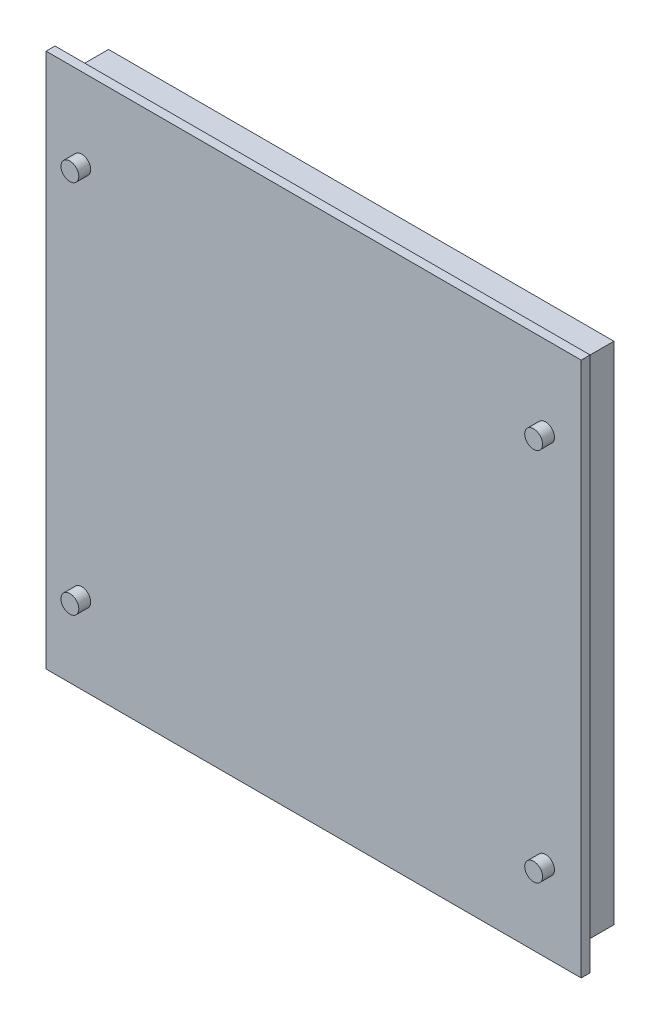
ISO-10303-21;
HEADER;
FILE_DESCRIPTION(('STEP AP214'),'2;1');
FILE_NAME('part.step','',(''),(''),'','','');
FILE_SCHEMA(('AUTOMOTIVE_DESIGN { 1 0 10303 214 1 1 1 1 }'));
ENDSEC;
DATA;
#1=APPLICATION_CONTEXT('core data for automotive mechanical design processes');
#2=APPLICATION_PROTOCOL_DEFINITION('international standard','automotive_design',2000,#1);
#3=PRODUCT_CONTEXT('',#1,'mechanical');
#4=PRODUCT('Part','Part','',(#3));
#5=PRODUCT_RELATED_PRODUCT_CATEGORY('part','',(#4));
#6=PRODUCT_DEFINITION_FORMATION('','',#4);
#7=PRODUCT_DEFINITION_CONTEXT('part definition',#1,'design');
#8=PRODUCT_DEFINITION('design','',#6,#7);
#9=PRODUCT_DEFINITION_SHAPE('','',#8);
#10=(LENGTH_UNIT() NAMED_UNIT(*) SI_UNIT(.MILLI.,.METRE.));
#11=(NAMED_UNIT(*) PLANE_ANGLE_UNIT() SI_UNIT($,.RADIAN.));
#12=(NAMED_UNIT(*) SI_UNIT($,.STERADIAN.) SOLID_ANGLE_UNIT());
#13=UNCERTAINTY_MEASURE_WITH_UNIT(LENGTH_MEASURE(1.E-05),#10,'distance_accuracy_value','');
#14=(GEOMETRIC_REPRESENTATION_CONTEXT(3) GLOBAL_UNCERTAINTY_ASSIGNED_CONTEXT((#13)) GLOBAL_UNIT_ASSIGNED_CONTEXT((#10,
#11,#12)) REPRESENTATION_CONTEXT('',''));
#15=CARTESIAN_POINT('',(0.,0.,0.));
#16=DIRECTION('',(0.,0.,1.));
#17=DIRECTION('',(1.,0.,0.));
#18=AXIS2_PLACEMENT_3D('',#15,#16,#17);
#19=CARTESIAN_POINT('',(0.,0.,-13.));
#20=DIRECTION('',(0.,0.,-1.));
#21=DIRECTION('',(-1.,0.,0.));
#22=AXIS2_PLACEMENT_3D('',#19,#20,#21);
#23=PLANE('',#22);
#24=DIRECTION('',(0.,-1.,0.));
#25=VECTOR('',#24,1.);
#26=CARTESIAN_POINT('',(84.9999999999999,85.,-13.));
#27=LINE('',#26,#25);
#28=CARTESIAN_POINT('',(84.9999999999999,85.,-13.));
#29=VERTEX_POINT('',#28);
#30=CARTESIAN_POINT('',(85.,-85.,-13.));
#31=VERTEX_POINT('',#30);
#32=EDGE_CURVE('E514',#29,#31,#27,.T.);
#33=ORIENTED_EDGE('',*,*,#32,.T.);
#34=DIRECTION('',(-1.,0.,0.));
#35=VECTOR('',#34,1.);
#36=CARTESIAN_POINT('',(85.,-85.,-13.));
#37=LINE('',#36,#35);
#38=CARTESIAN_POINT('',(-85.,-85.,-13.));
#39=VERTEX_POINT('',#38);
#40=EDGE_CURVE('E528',#31,#39,#37,.T.);
#41=ORIENTED_EDGE('',*,*,#40,.T.);
#42=DIRECTION('',(0.,1.,0.));
#43=VECTOR('',#42,1.);
#44=CARTESIAN_POINT('',(-85.,-85.,-13.));
#45=LINE('',#44,#43);
#46=CARTESIAN_POINT('',(-85.,85.,-13.));
#47=VERTEX_POINT('',#46);
#48=EDGE_CURVE('E526',#39,#47,#45,.T.);
#49=ORIENTED_EDGE('',*,*,#48,.T.);
#50=DIRECTION('',(1.,0.,0.));
#51=VECTOR('',#50,1.);
#52=CARTESIAN_POINT('',(-85.,85.,-13.));
#53=LINE('',#52,#51);
#54=EDGE_CURVE('E510',#47,#29,#53,.T.);
#55=ORIENTED_EDGE('',*,*,#54,.T.);
#56=EDGE_LOOP('',(#33,#41,#49,#55));
#57=FACE_BOUND('',#56,.T.);
#58=DIRECTION('',(-1.,0.,0.));
#59=VECTOR('',#58,1.);
#60=CARTESIAN_POINT('',(18.8348982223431,5.51834021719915,-13.));
#61=LINE('',#60,#59);
#62=CARTESIAN_POINT('',(18.8348982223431,5.51834021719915,-13.));
#63=VERTEX_POINT('',#62);
#64=CARTESIAN_POINT('',(6.78811459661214,5.51834021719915,-13.));
#65=VERTEX_POINT('',#64);
#66=EDGE_CURVE('E550',#63,#65,#61,.T.);
#67=ORIENTED_EDGE('',*,*,#66,.T.);
#68=DIRECTION('',(0.,-1.,0.));
#69=VECTOR('',#68,1.);
#70=CARTESIAN_POINT('',(6.78811459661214,5.51834021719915,-13.));
#71=LINE('',#70,#69);
#72=CARTESIAN_POINT('',(6.78811459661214,3.29611799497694,-13.));
#73=VERTEX_POINT('',#72);
#74=EDGE_CURVE('E291',#65,#73,#71,.T.);
#75=ORIENTED_EDGE('',*,*,#74,.T.);
#76=DIRECTION('',(1.,0.,0.));
#77=VECTOR('',#76,1.);
#78=CARTESIAN_POINT('',(6.78811459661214,3.29611799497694,-13.));
#79=LINE('',#78,#77);
#80=CARTESIAN_POINT('',(11.4664771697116,3.29611799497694,-13.));
#81=VERTEX_POINT('',#80);
#82=EDGE_CURVE('E295',#73,#81,#79,.T.);
#83=ORIENTED_EDGE('',*,*,#82,.T.);
#84=DIRECTION('',(0.,-1.,0.));
#85=VECTOR('',#84,1.);
#86=CARTESIAN_POINT('',(11.4664771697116,3.29611799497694,-13.));
#87=LINE('',#86,#85);
#88=CARTESIAN_POINT('',(11.4664771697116,-14.4816597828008,-13.));
#89=VERTEX_POINT('',#88);
#90=EDGE_CURVE('E566',#81,#89,#87,.T.);
#91=ORIENTED_EDGE('',*,*,#90,.T.);
#92=DIRECTION('',(1.,0.,0.));
#93=VECTOR('',#92,1.);
#94=CARTESIAN_POINT('',(11.4664771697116,-14.4816597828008,-13.));
#95=LINE('',#94,#93);
#96=CARTESIAN_POINT('',(14.1565356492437,-14.4816597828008,-13.));
#97=VERTEX_POINT('',#96);
#98=EDGE_CURVE('E563',#89,#97,#95,.T.);
#99=ORIENTED_EDGE('',*,*,#98,.T.);
#100=DIRECTION('',(0.,1.,0.));
#101=VECTOR('',#100,1.);
#102=CARTESIAN_POINT('',(14.1565356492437,-14.4816597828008,-13.));
#103=LINE('',#102,#101);
#104=CARTESIAN_POINT('',(14.1565356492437,3.29611799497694,-13.));
#105=VERTEX_POINT('',#104);
#106=EDGE_CURVE('E560',#97,#105,#103,.T.);
#107=ORIENTED_EDGE('',*,*,#106,.T.);
#108=DIRECTION('',(1.,0.,0.));
#109=VECTOR('',#108,1.);
#110=CARTESIAN_POINT('',(14.1565356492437,3.29611799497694,-13.));
#111=LINE('',#110,#109);
#112=CARTESIAN_POINT('',(18.8348982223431,3.29611799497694,-13.));
#113=VERTEX_POINT('',#112);
#114=EDGE_CURVE('E557',#105,#113,#111,.T.);
#115=ORIENTED_EDGE('',*,*,#114,.T.);
#116=DIRECTION('',(0.,1.,0.));
#117=VECTOR('',#116,1.);
#118=CARTESIAN_POINT('',(18.8348982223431,3.29611799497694,-13.));
#119=LINE('',#118,#117);
#120=EDGE_CURVE('E554',#113,#63,#119,.T.);
#121=ORIENTED_EDGE('',*,*,#120,.T.);
#122=EDGE_LOOP('',(#67,#75,#83,#91,#99,#107,#115,#121));
#123=FACE_BOUND('',#122,.T.);
#124=DIRECTION('',(1.,0.,0.));
#125=VECTOR('',#124,1.);
#126=CARTESIAN_POINT('',(-23.0364468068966,-14.3647007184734,-13.));
#127=LINE('',#126,#125);
#128=CARTESIAN_POINT('',(-23.0364468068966,-14.3647007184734,-13.));
#129=VERTEX_POINT('',#128);
#130=CARTESIAN_POINT('',(-11.2235813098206,-14.3647007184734,-13.));
#131=VERTEX_POINT('',#130);
#132=EDGE_CURVE('E305',#129,#131,#127,.T.);
#133=ORIENTED_EDGE('',*,*,#132,.T.);
#134=DIRECTION('',(0.,1.,0.));
#135=VECTOR('',#134,1.);
#136=CARTESIAN_POINT('',(-11.2235813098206,-14.3647007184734,-13.));
#137=LINE('',#136,#135);
#138=CARTESIAN_POINT('',(-11.2235813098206,-13.8968644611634,-13.));
#139=VERTEX_POINT('',#138);
#140=EDGE_CURVE('E58',#131,#139,#137,.T.);
#141=ORIENTED_EDGE('',*,*,#140,.T.);
#142=CARTESIAN_POINT('',(-11.2235813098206,-13.8968644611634,-13.));
#143=CARTESIAN_POINT('',(-11.2377296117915,-13.7519906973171,-13.));
#144=CARTESIAN_POINT('',(-11.2658500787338,-13.4640467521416,-13.));
#145=CARTESIAN_POINT('',(-11.3645927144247,-13.0404436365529,-13.));
#146=CARTESIAN_POINT('',(-11.5035308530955,-12.6268568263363,-13.));
#147=CARTESIAN_POINT('',(-11.686319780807,-12.2234717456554,-13.));
#148=CARTESIAN_POINT('',(-11.9120172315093,-11.830124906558,-13.));
#149=CARTESIAN_POINT('',(-12.1896306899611,-11.4551443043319,-13.));
#150=CARTESIAN_POINT('',(-12.4996350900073,-11.0820027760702,-13.));
#151=CARTESIAN_POINT('',(-12.870373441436,-10.7293194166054,-13.));
#152=CARTESIAN_POINT('',(-13.2701117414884,-10.354063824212,-13.));
#153=CARTESIAN_POINT('',(-13.68415466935,-9.92453710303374,-13.));
#154=CARTESIAN_POINT('',(-14.1326206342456,-9.45559799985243,-13.));
#155=CARTESIAN_POINT('',(-14.5973382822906,-8.92726201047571,-13.));
#156=CARTESIAN_POINT('',(-15.0979291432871,-8.35852843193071,-13.));
#157=CARTESIAN_POINT('',(-15.6151377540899,-7.73259320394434,-13.));
#158=CARTESIAN_POINT('',(-16.1613171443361,-7.0614280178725,-13.));
#159=CARTESIAN_POINT('',(-16.7211399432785,-6.35751170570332,-13.));
#160=CARTESIAN_POINT('',(-17.2697470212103,-5.65051416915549,-13.));
#161=CARTESIAN_POINT('',(-17.7753035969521,-4.96532813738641,-13.));
#162=CARTESIAN_POINT('',(-18.2350664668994,-4.32555377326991,-13.));
#163=CARTESIAN_POINT('',(-18.6453252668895,-3.72893240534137,-13.));
#164=CARTESIAN_POINT('',(-18.9951481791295,-3.16859081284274,-13.));
#165=CARTESIAN_POINT('',(-19.2989356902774,-2.65322444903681,-13.));
#166=CARTESIAN_POINT('',(-19.5581470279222,-2.18376524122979,-13.));
#167=CARTESIAN_POINT('',(-19.8168147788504,-1.62307468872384,-13.));
#168=CARTESIAN_POINT('',(-20.060945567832,-0.97645104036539,-13.));
#169=CARTESIAN_POINT('',(-20.2523703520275,-0.241867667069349,-13.));
#170=CARTESIAN_POINT('',(-20.3393566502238,0.437979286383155,-13.));
#171=CARTESIAN_POINT('',(-20.3051602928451,1.06271310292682,-13.));
#172=CARTESIAN_POINT('',(-20.1708742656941,1.63282686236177,-13.));
#173=CARTESIAN_POINT('',(-19.9362534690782,2.1500533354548,-13.));
#174=CARTESIAN_POINT('',(-19.6069986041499,2.61622971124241,-13.));
#175=CARTESIAN_POINT('',(-19.1860459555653,3.01392829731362,-13.));
#176=CARTESIAN_POINT('',(-18.7062109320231,3.34135253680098,-13.));
#177=CARTESIAN_POINT('',(-18.1722389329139,3.56134704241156,-13.));
#178=CARTESIAN_POINT('',(-17.6008939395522,3.67252690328,-13.));
#179=CARTESIAN_POINT('',(-17.0031615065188,3.66246806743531,-13.));
#180=CARTESIAN_POINT('',(-16.400669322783,3.55535237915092,-13.));
#181=CARTESIAN_POINT('',(-15.8004583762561,3.36916618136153,-13.));
#182=CARTESIAN_POINT('',(-15.2218490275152,3.08087976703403,-13.));
#183=CARTESIAN_POINT('',(-14.6549981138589,2.72123168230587,-13.));
#184=CARTESIAN_POINT('',(-14.1298054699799,2.25789623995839,-13.));
#185=CARTESIAN_POINT('',(-13.6681899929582,1.68731767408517,-13.));
#186=CARTESIAN_POINT('',(-13.2755015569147,1.01240262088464,-13.));
#187=CARTESIAN_POINT('',(-13.0795883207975,0.513806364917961,-13.));
#188=CARTESIAN_POINT('',(-12.9779672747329,0.255182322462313,-13.));
#189=B_SPLINE_CURVE_WITH_KNOTS('',3,(#142,#143,#144,#145,#146,#147,#148,#149,#150,#151,#152,
#153,#154,#155,#156,#157,#158,#159,#160,#161,#162,#163,#164,#165,#166,#167,#168,#169,#170,#171,
#172,#173,#174,#175,#176,#177,#178,#179,#180,#181,#182,#183,#184,#185,#186,#187,#188),
.UNSPECIFIED.,.F.,.F.,(4,1,1,1,1,1,1,1,1,1,1,1,1,1,1,1,1,1,1,1,1,1,1,1,1,1,1,1,1,1,1,1,1,1,1,1,
1,1,1,1,1,1,1,1,4),(0.,0.0155287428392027,0.0308641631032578,0.0463200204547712,
0.0620533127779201,0.0780792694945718,0.0946406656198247,0.111815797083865,0.129804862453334,
0.149215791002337,0.170367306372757,0.193489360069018,0.218495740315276,0.245488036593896,
0.27438870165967,0.305186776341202,0.337886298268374,0.370421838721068,0.400734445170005,
0.428802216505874,0.454546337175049,0.478031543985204,0.499318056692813,0.518427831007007,
0.535259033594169,0.565214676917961,0.5921015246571,0.616160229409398,0.638088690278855,
0.658544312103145,0.678348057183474,0.698368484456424,0.719087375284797,0.739869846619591,
0.760055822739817,0.780315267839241,0.801592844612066,0.823493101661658,0.845484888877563,
0.868447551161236,0.892311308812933,0.916997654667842,0.942859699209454,0.970361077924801,1.),.UNSPECIFIED.);
#190=CARTESIAN_POINT('',(-12.9779672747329,0.255182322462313,-13.));
#191=VERTEX_POINT('',#190);
#192=EDGE_CURVE('E630',#139,#191,#189,.T.);
#193=ORIENTED_EDGE('',*,*,#192,.T.);
#194=DIRECTION('',(0.987762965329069,0.155962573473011,0.));
#195=VECTOR('',#194,1.);
#196=CARTESIAN_POINT('',(-12.9779672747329,0.255182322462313,-13.));
#197=LINE('',#196,#195);
#198=CARTESIAN_POINT('',(-10.7557450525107,0.606059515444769,-13.));
#199=VERTEX_POINT('',#198);
#200=EDGE_CURVE('E624',#191,#199,#197,.T.);
#201=ORIENTED_EDGE('',*,*,#200,.T.);
#202=CARTESIAN_POINT('',(-10.7557450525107,0.606059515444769,-13.));
#203=CARTESIAN_POINT('',(-10.8342030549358,0.823591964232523,-13.));
#204=CARTESIAN_POINT('',(-10.9868482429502,1.24681560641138,-13.));
#205=CARTESIAN_POINT('',(-11.2496979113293,1.84946558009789,-13.));
#206=CARTESIAN_POINT('',(-11.5212278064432,2.4104543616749,-13.));
#207=CARTESIAN_POINT('',(-11.8088908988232,2.92606491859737,-13.));
#208=CARTESIAN_POINT('',(-12.1189278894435,3.39261682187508,-13.));
#209=CARTESIAN_POINT('',(-12.4438189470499,3.81464588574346,-13.));
#210=CARTESIAN_POINT('',(-12.7850117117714,4.19209556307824,-13.));
#211=CARTESIAN_POINT('',(-13.1438179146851,4.52452435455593,-13.));
#212=CARTESIAN_POINT('',(-13.5190053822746,4.81757648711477,-13.));
#213=CARTESIAN_POINT('',(-13.9131506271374,5.07172073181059,-13.));
#214=CARTESIAN_POINT('',(-14.3213459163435,5.29372253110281,-13.));
#215=CARTESIAN_POINT('',(-14.7451969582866,5.48213220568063,-13.));
#216=CARTESIAN_POINT('',(-15.1856190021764,5.63397189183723,-13.));
#217=CARTESIAN_POINT('',(-15.6445703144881,5.74439169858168,-13.));
#218=CARTESIAN_POINT('',(-16.1173566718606,5.83005537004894,-13.));
#219=CARTESIAN_POINT('',(-16.4401968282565,5.85605166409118,-13.));
#220=CARTESIAN_POINT('',(-16.6036982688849,5.86921741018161,-13.));
#221=B_SPLINE_CURVE_WITH_KNOTS('',3,(#202,#203,#204,#205,#206,#207,#208,#209,#210,#211,#212,
#213,#214,#215,#216,#217,#218,#219,#220),.UNSPECIFIED.,.F.,.F.,(4,1,1,1,1,1,1,1,1,1,1,1,1,1,1,1,
4),(0.,0.0824180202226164,0.160349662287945,0.234248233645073,0.304545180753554,
0.370646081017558,0.433761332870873,0.494252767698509,0.551803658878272,0.607920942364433,
0.663747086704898,0.718796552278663,0.773413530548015,0.828923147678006,0.884604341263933,
0.941558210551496,1.),.UNSPECIFIED.);
#222=CARTESIAN_POINT('',(-16.6036982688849,5.86921741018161,-13.));
#223=VERTEX_POINT('',#222);
#224=EDGE_CURVE('E616',#199,#223,#221,.T.);
#225=ORIENTED_EDGE('',*,*,#224,.T.);
#226=CARTESIAN_POINT('',(-16.6036982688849,5.86921741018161,-13.));
#227=CARTESIAN_POINT('',(-16.7941628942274,5.88449337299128,-13.));
#228=CARTESIAN_POINT('',(-17.1645797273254,5.91420216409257,-13.));
#229=CARTESIAN_POINT('',(-17.7074973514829,5.91979587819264,-13.));
#230=CARTESIAN_POINT('',(-18.2198626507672,5.88436017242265,-13.));
#231=CARTESIAN_POINT('',(-18.7107412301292,5.81706135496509,-13.));
#232=CARTESIAN_POINT('',(-19.1903040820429,5.69809264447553,-13.));
#233=CARTESIAN_POINT('',(-19.6709050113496,5.52254544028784,-13.));
#234=CARTESIAN_POINT('',(-20.1570890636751,5.28527391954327,-13.));
#235=CARTESIAN_POINT('',(-20.6480655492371,4.99425762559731,-13.));
#236=CARTESIAN_POINT('',(-21.1293375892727,4.63801191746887,-13.));
#237=CARTESIAN_POINT('',(-21.5650544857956,4.19005226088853,-13.));
#238=CARTESIAN_POINT('',(-21.949556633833,3.65905161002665,-13.));
#239=CARTESIAN_POINT('',(-22.2930995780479,3.05836085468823,-13.));
#240=CARTESIAN_POINT('',(-22.570394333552,2.38300309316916,-13.));
#241=CARTESIAN_POINT('',(-22.7371593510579,1.63075650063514,-13.));
#242=CARTESIAN_POINT('',(-22.7983119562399,0.814747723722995,-13.));
#243=CARTESIAN_POINT('',(-22.7647103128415,0.0949734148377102,-13.));
#244=CARTESIAN_POINT('',(-22.6828588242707,-0.514091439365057,-13.));
#245=CARTESIAN_POINT('',(-22.5681759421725,-1.00086724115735,-13.));
#246=CARTESIAN_POINT('',(-22.4028985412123,-1.50760185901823,-13.));
#247=CARTESIAN_POINT('',(-22.2083026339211,-2.04214385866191,-13.));
#248=CARTESIAN_POINT('',(-21.949900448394,-2.59181699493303,-13.));
#249=CARTESIAN_POINT('',(-21.6590501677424,-3.16842042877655,-13.));
#250=CARTESIAN_POINT('',(-21.3112391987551,-3.76150041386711,-13.));
#251=CARTESIAN_POINT('',(-20.9956032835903,-4.27389207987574,-13.));
#252=CARTESIAN_POINT('',(-20.7096336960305,-4.70051639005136,-13.));
#253=CARTESIAN_POINT('',(-20.4701091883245,-5.0486448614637,-13.));
#254=CARTESIAN_POINT('',(-20.2084420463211,-5.42025586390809,-13.));
#255=CARTESIAN_POINT('',(-19.914742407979,-5.80944086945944,-13.));
#256=CARTESIAN_POINT('',(-19.6045584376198,-6.22512337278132,-13.));
#257=CARTESIAN_POINT('',(-19.270901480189,-6.66371258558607,-13.));
#258=CARTESIAN_POINT('',(-18.9108673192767,-7.12140611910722,-13.));
#259=CARTESIAN_POINT('',(-18.5286205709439,-7.6040048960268,-13.));
#260=CARTESIAN_POINT('',(-18.122435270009,-8.11022193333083,-13.));
#261=CARTESIAN_POINT('',(-17.690478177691,-8.63712364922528,-13.));
#262=CARTESIAN_POINT('',(-17.2328686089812,-9.18352512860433,-13.));
#263=CARTESIAN_POINT('',(-16.7567275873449,-9.75683061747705,-13.));
#264=CARTESIAN_POINT('',(-16.2562572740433,-10.3522348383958,-13.));
#265=CARTESIAN_POINT('',(-15.7310744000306,-10.9691767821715,-13.));
#266=CARTESIAN_POINT('',(-15.1794444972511,-11.6048764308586,-13.));
#267=CARTESIAN_POINT('',(-14.8058645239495,-12.0384032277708,-13.));
#268=CARTESIAN_POINT('',(-14.6153941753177,-12.2594375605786,-13.));
#269=B_SPLINE_CURVE_WITH_KNOTS('',3,(#226,#227,#228,#229,#230,#231,#232,#233,#234,#235,#236,
#237,#238,#239,#240,#241,#242,#243,#244,#245,#246,#247,#248,#249,#250,#251,#252,#253,#254,#255,
#256,#257,#258,#259,#260,#261,#262,#263,#264,#265,#266,#267,#268),.UNSPECIFIED.,.F.,.F.,(4,1,1,
1,1,1,1,1,1,1,1,1,1,1,1,1,1,1,1,1,1,1,1,1,1,1,1,1,1,1,1,1,1,1,1,1,1,1,1,1,4),(0.,
0.0231065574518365,0.04493778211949,0.0655931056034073,0.0851789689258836,0.104790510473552,
0.125232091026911,0.14694704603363,0.170129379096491,0.194195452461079,0.21914208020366,
0.24537477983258,0.273297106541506,0.30267940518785,0.333310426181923,0.36607379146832,
0.40138691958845,0.420256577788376,0.44033686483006,0.461767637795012,0.484701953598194,
0.509085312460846,0.535172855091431,0.562792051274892,0.592208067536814,0.607950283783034,
0.624905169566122,0.643319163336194,0.662914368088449,0.683871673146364,0.706052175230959,
0.729564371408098,0.754302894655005,0.780514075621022,0.808063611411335,0.836707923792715,
0.866716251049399,0.898200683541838,0.930782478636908,0.964709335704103,1.),.UNSPECIFIED.);
#270=CARTESIAN_POINT('',(-14.6153941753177,-12.2594375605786,-13.));
#271=VERTEX_POINT('',#270);
#272=EDGE_CURVE('E611',#223,#271,#269,.T.);
#273=ORIENTED_EDGE('',*,*,#272,.T.);
#274=DIRECTION('',(-1.,0.,0.));
#275=VECTOR('',#274,1.);
#276=CARTESIAN_POINT('',(-14.6153941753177,-12.2594375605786,-13.));
#277=LINE('',#276,#275);
#278=CARTESIAN_POINT('',(-23.0364468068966,-12.2594375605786,-13.));
#279=VERTEX_POINT('',#278);
#280=EDGE_CURVE('E608',#271,#279,#277,.T.);
#281=ORIENTED_EDGE('',*,*,#280,.T.);
#282=DIRECTION('',(0.,-1.,0.));
#283=VECTOR('',#282,1.);
#284=CARTESIAN_POINT('',(-23.0364468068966,-12.2594375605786,-13.));
#285=LINE('',#284,#283);
#286=EDGE_CURVE('E605',#279,#129,#285,.T.);
#287=ORIENTED_EDGE('',*,*,#286,.T.);
#288=EDGE_LOOP('',(#133,#141,#193,#201,#225,#273,#281,#287));
#289=FACE_BOUND('',#288,.T.);
#290=DIRECTION('',(0.460317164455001,-0.887754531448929,0.));
#291=VECTOR('',#290,1.);
#292=CARTESIAN_POINT('',(-8.29960470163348,5.51834021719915,-13.));
#293=LINE('',#292,#291);
#294=CARTESIAN_POINT('',(-8.29960470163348,5.51834021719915,-13.));
#295=VERTEX_POINT('',#294);
#296=CARTESIAN_POINT('',(-3.38732399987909,-3.95534399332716,-13.));
#297=VERTEX_POINT('',#296);
#298=EDGE_CURVE('E286',#295,#297,#293,.T.);
#299=ORIENTED_EDGE('',*,*,#298,.T.);
#300=DIRECTION('',(-0.462902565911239,-0.886409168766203,0.));
#301=VECTOR('',#300,1.);
#302=CARTESIAN_POINT('',(-3.38732399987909,-3.95534399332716,-13.));
#303=LINE('',#302,#301);
#304=CARTESIAN_POINT('',(-8.8844000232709,-14.4816597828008,-13.));
#305=VERTEX_POINT('',#304);
#306=EDGE_CURVE('E50',#297,#305,#303,.T.);
#307=ORIENTED_EDGE('',*,*,#306,.T.);
#308=DIRECTION('',(1.,0.,0.));
#309=VECTOR('',#308,1.);
#310=CARTESIAN_POINT('',(-8.8844000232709,-14.4816597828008,-13.));
#311=LINE('',#310,#309);
#312=CARTESIAN_POINT('',(-6.07738247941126,-14.4816597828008,-13.));
#313=VERTEX_POINT('',#312);
#314=EDGE_CURVE('E290',#305,#313,#311,.T.);
#315=ORIENTED_EDGE('',*,*,#314,.T.);
#316=DIRECTION('',(0.436903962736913,0.899508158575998,0.));
#317=VECTOR('',#316,1.);
#318=CARTESIAN_POINT('',(-6.07738247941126,-14.4816597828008,-13.));
#319=LINE('',#318,#317);
#320=CARTESIAN_POINT('',(-2.10077429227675,-6.29452527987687,-13.));
#321=VERTEX_POINT('',#320);
#322=EDGE_CURVE('E1084',#313,#321,#319,.T.);
#323=ORIENTED_EDGE('',*,*,#322,.T.);
#324=DIRECTION('',(0.436903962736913,-0.899508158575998,0.));
#325=VECTOR('',#324,1.);
#326=CARTESIAN_POINT('',(-2.10077429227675,-6.29452527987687,-13.));
#327=LINE('',#326,#325);
#328=CARTESIAN_POINT('',(1.87583389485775,-14.4816597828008,-13.));
#329=VERTEX_POINT('',#328);
#330=EDGE_CURVE('E1086',#321,#329,#327,.T.);
#331=ORIENTED_EDGE('',*,*,#330,.T.);
#332=DIRECTION('',(1.,0.,0.));
#333=VECTOR('',#332,1.);
#334=CARTESIAN_POINT('',(1.87583389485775,-14.4816597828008,-13.));
#335=LINE('',#334,#333);
#336=CARTESIAN_POINT('',(4.6828514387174,-14.4816597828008,-13.));
#337=VERTEX_POINT('',#336);
#338=EDGE_CURVE('E1090',#329,#337,#335,.T.);
#339=ORIENTED_EDGE('',*,*,#338,.T.);
#340=DIRECTION('',(-0.46290256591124,0.886409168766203,0.));
#341=VECTOR('',#340,1.);
#342=CARTESIAN_POINT('',(4.6828514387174,-14.4816597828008,-13.));
#343=LINE('',#342,#341);
#344=CARTESIAN_POINT('',(-0.814224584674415,-3.95534399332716,-13.));
#345=VERTEX_POINT('',#344);
#346=EDGE_CURVE('E1097',#337,#345,#343,.T.);
#347=ORIENTED_EDGE('',*,*,#346,.T.);
#348=DIRECTION('',(0.460317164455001,0.887754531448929,0.));
#349=VECTOR('',#348,1.);
#350=CARTESIAN_POINT('',(-0.814224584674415,-3.95534399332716,-13.));
#351=LINE('',#350,#349);
#352=CARTESIAN_POINT('',(4.09805611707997,5.51834021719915,-13.));
#353=VERTEX_POINT('',#352);
#354=EDGE_CURVE('E1100',#345,#353,#351,.T.);
#355=ORIENTED_EDGE('',*,*,#354,.T.);
#356=DIRECTION('',(-1.,0.,0.));
#357=VECTOR('',#356,1.);
#358=CARTESIAN_POINT('',(4.09805611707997,5.51834021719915,-13.));
#359=LINE('',#358,#357);
#360=CARTESIAN_POINT('',(1.29103857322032,5.51834021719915,-13.));
#361=VERTEX_POINT('',#360);
#362=EDGE_CURVE('E1103',#353,#361,#359,.T.);
#363=ORIENTED_EDGE('',*,*,#362,.T.);
#364=DIRECTION('',(-0.423685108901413,-0.905809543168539,0.));
#365=VECTOR('',#364,1.);
#366=CARTESIAN_POINT('',(1.29103857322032,5.51834021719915,-13.));
#367=LINE('',#366,#365);
#368=CARTESIAN_POINT('',(-2.10077429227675,-1.73312177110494,-13.));
#369=VERTEX_POINT('',#368);
#370=EDGE_CURVE('E1060',#361,#369,#367,.T.);
#371=ORIENTED_EDGE('',*,*,#370,.T.);
#372=DIRECTION('',(-0.423685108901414,0.905809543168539,0.));
#373=VECTOR('',#372,1.);
#374=CARTESIAN_POINT('',(-2.10077429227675,-1.73312177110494,-13.));
#375=LINE('',#374,#373);
#376=CARTESIAN_POINT('',(-5.49258715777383,5.51834021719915,-13.));
#377=VERTEX_POINT('',#376);
#378=EDGE_CURVE('E1057',#369,#377,#375,.T.);
#379=ORIENTED_EDGE('',*,*,#378,.T.);
#380=DIRECTION('',(-1.,0.,0.));
#381=VECTOR('',#380,1.);
#382=CARTESIAN_POINT('',(-5.49258715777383,5.51834021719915,-13.));
#383=LINE('',#382,#381);
#384=EDGE_CURVE('E1051',#377,#295,#383,.T.);
#385=ORIENTED_EDGE('',*,*,#384,.T.);
#386=EDGE_LOOP('',(#299,#307,#315,#323,#331,#339,#347,#355,#363,#371,#379,#385));
#387=FACE_BOUND('',#386,.T.);
#388=ADVANCED_FACE('F35',(#57,#123,#289,#387),#23,.T.);
#389=CARTESIAN_POINT('',(0.,0.,0.));
#390=DIRECTION('',(0.,0.,1.));
#391=DIRECTION('',(1.,0.,0.));
#392=AXIS2_PLACEMENT_3D('',#389,#390,#391);
#393=PLANE('',#392);
#394=DIRECTION('',(0.,1.,0.));
#395=VECTOR('',#394,1.);
#396=CARTESIAN_POINT('',(89.9999999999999,90.,0.));
#397=LINE('',#396,#395);
#398=CARTESIAN_POINT('',(90.,-90.,0.));
#399=VERTEX_POINT('',#398);
#400=CARTESIAN_POINT('',(89.9999999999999,90.,0.));
#401=VERTEX_POINT('',#400);
#402=EDGE_CURVE('E444',#399,#401,#397,.T.);
#403=ORIENTED_EDGE('',*,*,#402,.F.);
#404=DIRECTION('',(1.,0.,0.));
#405=VECTOR('',#404,1.);
#406=CARTESIAN_POINT('',(-90.,-90.,0.));
#407=LINE('',#406,#405);
#408=CARTESIAN_POINT('',(-90.,-90.,0.));
#409=VERTEX_POINT('',#408);
#410=EDGE_CURVE('E452',#409,#399,#407,.T.);
#411=ORIENTED_EDGE('',*,*,#410,.F.);
#412=DIRECTION('',(0.,-1.,0.));
#413=VECTOR('',#412,1.);
#414=CARTESIAN_POINT('',(-90.0000000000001,90.,0.));
#415=LINE('',#414,#413);
#416=CARTESIAN_POINT('',(-90.0000000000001,90.,0.));
#417=VERTEX_POINT('',#416);
#418=EDGE_CURVE('E443',#417,#409,#415,.T.);
#419=ORIENTED_EDGE('',*,*,#418,.F.);
#420=DIRECTION('',(-1.,0.,0.));
#421=VECTOR('',#420,1.);
#422=CARTESIAN_POINT('',(-90.0000000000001,90.,0.));
#423=LINE('',#422,#421);
#424=EDGE_CURVE('E436',#401,#417,#423,.T.);
#425=ORIENTED_EDGE('',*,*,#424,.F.);
#426=EDGE_LOOP('',(#403,#411,#419,#425));
#427=FACE_BOUND('',#426,.T.);
#428=DIRECTION('',(0.,-1.,0.));
#429=VECTOR('',#428,1.);
#430=CARTESIAN_POINT('',(84.9999999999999,85.,0.));
#431=LINE('',#430,#429);
#432=CARTESIAN_POINT('',(84.9999999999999,85.,0.));
#433=VERTEX_POINT('',#432);
#434=CARTESIAN_POINT('',(85.,-85.,0.));
#435=VERTEX_POINT('',#434);
#436=EDGE_CURVE('E521',#433,#435,#431,.T.);
#437=ORIENTED_EDGE('',*,*,#436,.F.);
#438=DIRECTION('',(1.,0.,0.));
#439=VECTOR('',#438,1.);
#440=CARTESIAN_POINT('',(-85.,85.,0.));
#441=LINE('',#440,#439);
#442=CARTESIAN_POINT('',(-85.,85.,0.));
#443=VERTEX_POINT('',#442);
#444=EDGE_CURVE('E511',#443,#433,#441,.T.);
#445=ORIENTED_EDGE('',*,*,#444,.F.);
#446=DIRECTION('',(0.,1.,0.));
#447=VECTOR('',#446,1.);
#448=CARTESIAN_POINT('',(-85.,-85.,0.));
#449=LINE('',#448,#447);
#450=CARTESIAN_POINT('',(-85.,-85.,0.));
#451=VERTEX_POINT('',#450);
#452=EDGE_CURVE('E515',#451,#443,#449,.T.);
#453=ORIENTED_EDGE('',*,*,#452,.F.);
#454=DIRECTION('',(-1.,0.,0.));
#455=VECTOR('',#454,1.);
#456=CARTESIAN_POINT('',(85.,-85.,0.));
#457=LINE('',#456,#455);
#458=EDGE_CURVE('E518',#435,#451,#457,.T.);
#459=ORIENTED_EDGE('',*,*,#458,.F.);
#460=EDGE_LOOP('',(#437,#445,#453,#459));
#461=FACE_BOUND('',#460,.T.);
#462=ADVANCED_FACE('F365',(#427,#461),#393,.F.);
#463=CARTESIAN_POINT('',(89.9999999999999,90.,3.));
#464=DIRECTION('',(-1.,0.,0.));
#465=DIRECTION('',(0.,-1.,0.));
#466=AXIS2_PLACEMENT_3D('',#463,#464,#465);
#467=PLANE('',#466);
#468=ORIENTED_EDGE('',*,*,#402,.T.);
#469=DIRECTION('',(0.,0.,-1.));
#470=VECTOR('',#469,1.);
#471=CARTESIAN_POINT('',(89.9999999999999,90.,3.));
#472=LINE('',#471,#470);
#473=CARTESIAN_POINT('',(89.9999999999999,90.,3.));
#474=VERTEX_POINT('',#473);
#475=EDGE_CURVE('E11',#474,#401,#472,.T.);
#476=ORIENTED_EDGE('',*,*,#475,.F.);
#477=DIRECTION('',(0.,1.,0.));
#478=VECTOR('',#477,1.);
#479=CARTESIAN_POINT('',(89.9999999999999,90.,3.));
#480=LINE('',#479,#478);
#481=CARTESIAN_POINT('',(90.,-90.,3.));
#482=VERTEX_POINT('',#481);
#483=EDGE_CURVE('E454',#482,#474,#480,.T.);
#484=ORIENTED_EDGE('',*,*,#483,.F.);
#485=DIRECTION('',(0.,0.,-1.));
#486=VECTOR('',#485,1.);
#487=CARTESIAN_POINT('',(90.,-90.,3.));
#488=LINE('',#487,#486);
#489=EDGE_CURVE('E458',#482,#399,#488,.T.);
#490=ORIENTED_EDGE('',*,*,#489,.T.);
#491=EDGE_LOOP('',(#468,#476,#484,#490));
#492=FACE_BOUND('',#491,.T.);
#493=ADVANCED_FACE('F37',(#492),#467,.F.);
#494=CARTESIAN_POINT('',(-90.0000000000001,90.,3.));
#495=DIRECTION('',(0.,-1.,0.));
#496=DIRECTION('',(0.,0.,-1.));
#497=AXIS2_PLACEMENT_3D('',#494,#495,#496);
#498=PLANE('',#497);
#499=ORIENTED_EDGE('',*,*,#424,.T.);
#500=DIRECTION('',(0.,0.,-1.));
#501=VECTOR('',#500,1.);
#502=CARTESIAN_POINT('',(-90.0000000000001,90.,3.));
#503=LINE('',#502,#501);
#504=CARTESIAN_POINT('',(-90.0000000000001,90.,3.));
#505=VERTEX_POINT('',#504);
#506=EDGE_CURVE('E43',#505,#417,#503,.T.);
#507=ORIENTED_EDGE('',*,*,#506,.F.);
#508=DIRECTION('',(-1.,0.,0.));
#509=VECTOR('',#508,1.);
#510=CARTESIAN_POINT('',(-90.0000000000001,90.,3.));
#511=LINE('',#510,#509);
#512=EDGE_CURVE('E468',#474,#505,#511,.T.);
#513=ORIENTED_EDGE('',*,*,#512,.F.);
#514=ORIENTED_EDGE('',*,*,#475,.T.);
#515=EDGE_LOOP('',(#499,#507,#513,#514));
#516=FACE_BOUND('',#515,.T.);
#517=ADVANCED_FACE('F427',(#516),#498,.F.);
#518=CARTESIAN_POINT('',(-90.0000000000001,90.,3.));
#519=DIRECTION('',(1.,0.,0.));
#520=DIRECTION('',(0.,1.,0.));
#521=AXIS2_PLACEMENT_3D('',#518,#519,#520);
#522=PLANE('',#521);
#523=ORIENTED_EDGE('',*,*,#418,.T.);
#524=DIRECTION('',(0.,0.,-1.));
#525=VECTOR('',#524,1.);
#526=CARTESIAN_POINT('',(-90.,-90.,3.));
#527=LINE('',#526,#525);
#528=CARTESIAN_POINT('',(-90.,-90.,3.));
#529=VERTEX_POINT('',#528);
#530=EDGE_CURVE('E449',#529,#409,#527,.T.);
#531=ORIENTED_EDGE('',*,*,#530,.F.);
#532=DIRECTION('',(0.,-1.,0.));
#533=VECTOR('',#532,1.);
#534=CARTESIAN_POINT('',(-90.0000000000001,90.,3.));
#535=LINE('',#534,#533);
#536=EDGE_CURVE('E448',#505,#529,#535,.T.);
#537=ORIENTED_EDGE('',*,*,#536,.F.);
#538=ORIENTED_EDGE('',*,*,#506,.T.);
#539=EDGE_LOOP('',(#523,#531,#537,#538));
#540=FACE_BOUND('',#539,.T.);
#541=ADVANCED_FACE('F424',(#540),#522,.F.);
#542=CARTESIAN_POINT('',(-90.,-90.,3.));
#543=DIRECTION('',(0.,1.,0.));
#544=DIRECTION('',(0.,0.,1.));
#545=AXIS2_PLACEMENT_3D('',#542,#543,#544);
#546=PLANE('',#545);
#547=ORIENTED_EDGE('',*,*,#410,.T.);
#548=ORIENTED_EDGE('',*,*,#489,.F.);
#549=DIRECTION('',(1.,0.,0.));
#550=VECTOR('',#549,1.);
#551=CARTESIAN_POINT('',(-90.,-90.,3.));
#552=LINE('',#551,#550);
#553=EDGE_CURVE('E461',#529,#482,#552,.T.);
#554=ORIENTED_EDGE('',*,*,#553,.F.);
#555=ORIENTED_EDGE('',*,*,#530,.T.);
#556=EDGE_LOOP('',(#547,#548,#554,#555));
#557=FACE_BOUND('',#556,.T.);
#558=ADVANCED_FACE('F417',(#557),#546,.F.);
#559=CARTESIAN_POINT('',(0.,0.,3.));
#560=DIRECTION('',(0.,0.,1.));
#561=DIRECTION('',(1.,0.,0.));
#562=AXIS2_PLACEMENT_3D('',#559,#560,#561);
#563=PLANE('',#562);
#564=CARTESIAN_POINT('',(78.,63.,3.));
#565=DIRECTION('',(0.,0.,1.));
#566=DIRECTION('',(1.,0.,0.));
#567=AXIS2_PLACEMENT_3D('',#564,#565,#566);
#568=CIRCLE('',#567,3.00000000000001);
#569=CARTESIAN_POINT('',(81.,63.,3.));
#570=VERTEX_POINT('',#569);
#571=EDGE_CURVE('E493',#570,#570,#568,.T.);
#572=ORIENTED_EDGE('',*,*,#571,.F.);
#573=EDGE_LOOP('',(#572));
#574=FACE_BOUND('',#573,.T.);
#575=CARTESIAN_POINT('',(78.,-63.,3.));
#576=DIRECTION('',(0.,0.,1.));
#577=DIRECTION('',(1.,0.,0.));
#578=AXIS2_PLACEMENT_3D('',#575,#576,#577);
#579=CIRCLE('',#578,3.00000000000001);
#580=CARTESIAN_POINT('',(81.,-63.,3.));
#581=VERTEX_POINT('',#580);
#582=EDGE_CURVE('E487',#581,#581,#579,.T.);
#583=ORIENTED_EDGE('',*,*,#582,.F.);
#584=EDGE_LOOP('',(#583));
#585=FACE_BOUND('',#584,.T.);
#586=CARTESIAN_POINT('',(-78.0000000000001,-63.,3.));
#587=DIRECTION('',(0.,0.,1.));
#588=DIRECTION('',(1.,0.,0.));
#589=AXIS2_PLACEMENT_3D('',#586,#587,#588);
#590=CIRCLE('',#589,3.00000000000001);
#591=CARTESIAN_POINT('',(-75.0000000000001,-63.,3.));
#592=VERTEX_POINT('',#591);
#593=EDGE_CURVE('E480',#592,#592,#590,.T.);
#594=ORIENTED_EDGE('',*,*,#593,.F.);
#595=EDGE_LOOP('',(#594));
#596=FACE_BOUND('',#595,.T.);
#597=CARTESIAN_POINT('',(-78.0000000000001,63.,3.));
#598=DIRECTION('',(0.,0.,1.));
#599=DIRECTION('',(1.,0.,0.));
#600=AXIS2_PLACEMENT_3D('',#597,#598,#599);
#601=CIRCLE('',#600,3.00000000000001);
#602=CARTESIAN_POINT('',(-75.0000000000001,63.,3.));
#603=VERTEX_POINT('',#602);
#604=EDGE_CURVE('E473',#603,#603,#601,.T.);
#605=ORIENTED_EDGE('',*,*,#604,.F.);
#606=EDGE_LOOP('',(#605));
#607=FACE_BOUND('',#606,.T.);
#608=ORIENTED_EDGE('',*,*,#483,.T.);
#609=ORIENTED_EDGE('',*,*,#512,.T.);
#610=ORIENTED_EDGE('',*,*,#536,.T.);
#611=ORIENTED_EDGE('',*,*,#553,.T.);
#612=EDGE_LOOP('',(#608,#609,#610,#611));
#613=FACE_BOUND('',#612,.T.);
#614=ADVANCED_FACE('F413',(#574,#585,#596,#607,#613),#563,.T.);
#615=CARTESIAN_POINT('',(-78.0000000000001,63.,7.));
#616=DIRECTION('',(0.,0.,-1.));
#617=DIRECTION('',(-1.,0.,0.));
#618=AXIS2_PLACEMENT_3D('',#615,#616,#617);
#619=CYLINDRICAL_SURFACE('',#618,3.00000000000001);
#620=CARTESIAN_POINT('',(-78.0000000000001,63.,7.));
#621=DIRECTION('',(0.,0.,1.));
#622=DIRECTION('',(1.,0.,0.));
#623=AXIS2_PLACEMENT_3D('',#620,#621,#622);
#624=CIRCLE('',#623,3.00000000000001);
#625=CARTESIAN_POINT('',(-75.0000000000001,63.,7.));
#626=VERTEX_POINT('',#625);
#627=EDGE_CURVE('E471',#626,#626,#624,.T.);
#628=ORIENTED_EDGE('',*,*,#627,.F.);
#629=EDGE_LOOP('',(#628));
#630=FACE_BOUND('',#629,.T.);
#631=ORIENTED_EDGE('',*,*,#604,.T.);
#632=EDGE_LOOP('',(#631));
#633=FACE_BOUND('',#632,.T.);
#634=ADVANCED_FACE('F409',(#630,#633),#619,.T.);
#635=CARTESIAN_POINT('',(-78.0000000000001,63.,7.));
#636=DIRECTION('',(0.,0.,1.));
#637=DIRECTION('',(1.,0.,0.));
#638=AXIS2_PLACEMENT_3D('',#635,#636,#637);
#639=PLANE('',#638);
#640=ORIENTED_EDGE('',*,*,#627,.T.);
#641=EDGE_LOOP('',(#640));
#642=FACE_BOUND('',#641,.T.);
#643=ADVANCED_FACE('F405',(#642),#639,.T.);
#644=CARTESIAN_POINT('',(-78.0000000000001,-63.,7.));
#645=DIRECTION('',(0.,0.,-1.));
#646=DIRECTION('',(-1.,0.,0.));
#647=AXIS2_PLACEMENT_3D('',#644,#645,#646);
#648=CYLINDRICAL_SURFACE('',#647,3.00000000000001);
#649=CARTESIAN_POINT('',(-78.0000000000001,-63.,7.));
#650=DIRECTION('',(0.,0.,1.));
#651=DIRECTION('',(1.,0.,0.));
#652=AXIS2_PLACEMENT_3D('',#649,#650,#651);
#653=CIRCLE('',#652,3.00000000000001);
#654=CARTESIAN_POINT('',(-75.0000000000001,-63.,7.));
#655=VERTEX_POINT('',#654);
#656=EDGE_CURVE('E477',#655,#655,#653,.T.);
#657=ORIENTED_EDGE('',*,*,#656,.F.);
#658=EDGE_LOOP('',(#657));
#659=FACE_BOUND('',#658,.T.);
#660=ORIENTED_EDGE('',*,*,#593,.T.);
#661=EDGE_LOOP('',(#660));
#662=FACE_BOUND('',#661,.T.);
#663=ADVANCED_FACE('F401',(#659,#662),#648,.T.);
#664=CARTESIAN_POINT('',(-78.0000000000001,-63.,7.));
#665=DIRECTION('',(0.,0.,1.));
#666=DIRECTION('',(1.,0.,0.));
#667=AXIS2_PLACEMENT_3D('',#664,#665,#666);
#668=PLANE('',#667);
#669=ORIENTED_EDGE('',*,*,#656,.T.);
#670=EDGE_LOOP('',(#669));
#671=FACE_BOUND('',#670,.T.);
#672=ADVANCED_FACE('F397',(#671),#668,.T.);
#673=CARTESIAN_POINT('',(78.,-63.,7.));
#674=DIRECTION('',(0.,0.,-1.));
#675=DIRECTION('',(-1.,0.,0.));
#676=AXIS2_PLACEMENT_3D('',#673,#674,#675);
#677=CYLINDRICAL_SURFACE('',#676,3.00000000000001);
#678=CARTESIAN_POINT('',(78.,-63.,7.));
#679=DIRECTION('',(0.,0.,1.));
#680=DIRECTION('',(1.,0.,0.));
#681=AXIS2_PLACEMENT_3D('',#678,#679,#680);
#682=CIRCLE('',#681,3.00000000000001);
#683=CARTESIAN_POINT('',(81.,-63.,7.));
#684=VERTEX_POINT('',#683);
#685=EDGE_CURVE('E484',#684,#684,#682,.T.);
#686=ORIENTED_EDGE('',*,*,#685,.F.);
#687=EDGE_LOOP('',(#686));
#688=FACE_BOUND('',#687,.T.);
#689=ORIENTED_EDGE('',*,*,#582,.T.);
#690=EDGE_LOOP('',(#689));
#691=FACE_BOUND('',#690,.T.);
#692=ADVANCED_FACE('F393',(#688,#691),#677,.T.);
#693=CARTESIAN_POINT('',(78.,-63.,7.));
#694=DIRECTION('',(0.,0.,1.));
#695=DIRECTION('',(1.,0.,0.));
#696=AXIS2_PLACEMENT_3D('',#693,#694,#695);
#697=PLANE('',#696);
#698=ORIENTED_EDGE('',*,*,#685,.T.);
#699=EDGE_LOOP('',(#698));
#700=FACE_BOUND('',#699,.T.);
#701=ADVANCED_FACE('F389',(#700),#697,.T.);
#702=CARTESIAN_POINT('',(78.,63.,7.));
#703=DIRECTION('',(0.,0.,-1.));
#704=DIRECTION('',(-1.,0.,0.));
#705=AXIS2_PLACEMENT_3D('',#702,#703,#704);
#706=CYLINDRICAL_SURFACE('',#705,3.00000000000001);
#707=CARTESIAN_POINT('',(78.,63.,7.));
#708=DIRECTION('',(0.,0.,1.));
#709=DIRECTION('',(1.,0.,0.));
#710=AXIS2_PLACEMENT_3D('',#707,#708,#709);
#711=CIRCLE('',#710,3.00000000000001);
#712=CARTESIAN_POINT('',(81.,63.,7.));
#713=VERTEX_POINT('',#712);
#714=EDGE_CURVE('E490',#713,#713,#711,.T.);
#715=ORIENTED_EDGE('',*,*,#714,.F.);
#716=EDGE_LOOP('',(#715));
#717=FACE_BOUND('',#716,.T.);
#718=ORIENTED_EDGE('',*,*,#571,.T.);
#719=EDGE_LOOP('',(#718));
#720=FACE_BOUND('',#719,.T.);
#721=ADVANCED_FACE('F385',(#717,#720),#706,.T.);
#722=CARTESIAN_POINT('',(78.,63.,7.));
#723=DIRECTION('',(0.,0.,1.));
#724=DIRECTION('',(1.,0.,0.));
#725=AXIS2_PLACEMENT_3D('',#722,#723,#724);
#726=PLANE('',#725);
#727=ORIENTED_EDGE('',*,*,#714,.T.);
#728=EDGE_LOOP('',(#727));
#729=FACE_BOUND('',#728,.T.);
#730=ADVANCED_FACE('F381',(#729),#726,.T.);
#731=CARTESIAN_POINT('',(84.9999999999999,85.,-13.));
#732=DIRECTION('',(-1.,0.,0.));
#733=DIRECTION('',(0.,-1.,0.));
#734=AXIS2_PLACEMENT_3D('',#731,#732,#733);
#735=PLANE('',#734);
#736=ORIENTED_EDGE('',*,*,#436,.T.);
#737=DIRECTION('',(0.,0.,1.));
#738=VECTOR('',#737,1.);
#739=CARTESIAN_POINT('',(85.,-85.,-13.));
#740=LINE('',#739,#738);
#741=EDGE_CURVE('E496',#31,#435,#740,.T.);
#742=ORIENTED_EDGE('',*,*,#741,.F.);
#743=ORIENTED_EDGE('',*,*,#32,.F.);
#744=DIRECTION('',(0.,0.,1.));
#745=VECTOR('',#744,1.);
#746=CARTESIAN_POINT('',(84.9999999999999,85.,-13.));
#747=LINE('',#746,#745);
#748=EDGE_CURVE('E507',#29,#433,#747,.T.);
#749=ORIENTED_EDGE('',*,*,#748,.T.);
#750=EDGE_LOOP('',(#736,#742,#743,#749));
#751=FACE_BOUND('',#750,.T.);
#752=ADVANCED_FACE('F377',(#751),#735,.F.);
#753=CARTESIAN_POINT('',(85.,-85.,-13.));
#754=DIRECTION('',(0.,1.,0.));
#755=DIRECTION('',(0.,0.,1.));
#756=AXIS2_PLACEMENT_3D('',#753,#754,#755);
#757=PLANE('',#756);
#758=ORIENTED_EDGE('',*,*,#458,.T.);
#759=DIRECTION('',(0.,0.,1.));
#760=VECTOR('',#759,1.);
#761=CARTESIAN_POINT('',(-85.,-85.,-13.));
#762=LINE('',#761,#760);
#763=EDGE_CURVE('E501',#39,#451,#762,.T.);
#764=ORIENTED_EDGE('',*,*,#763,.F.);
#765=ORIENTED_EDGE('',*,*,#40,.F.);
#766=ORIENTED_EDGE('',*,*,#741,.T.);
#767=EDGE_LOOP('',(#758,#764,#765,#766));
#768=FACE_BOUND('',#767,.T.);
#769=ADVANCED_FACE('F373',(#768),#757,.F.);
#770=CARTESIAN_POINT('',(-85.,-85.,-13.));
#771=DIRECTION('',(1.,0.,0.));
#772=DIRECTION('',(0.,1.,0.));
#773=AXIS2_PLACEMENT_3D('',#770,#771,#772);
#774=PLANE('',#773);
#775=ORIENTED_EDGE('',*,*,#452,.T.);
#776=DIRECTION('',(0.,0.,1.));
#777=VECTOR('',#776,1.);
#778=CARTESIAN_POINT('',(-85.,85.,-13.));
#779=LINE('',#778,#777);
#780=EDGE_CURVE('E504',#47,#443,#779,.T.);
#781=ORIENTED_EDGE('',*,*,#780,.F.);
#782=ORIENTED_EDGE('',*,*,#48,.F.);
#783=ORIENTED_EDGE('',*,*,#763,.T.);
#784=EDGE_LOOP('',(#775,#781,#782,#783));
#785=FACE_BOUND('',#784,.T.);
#786=ADVANCED_FACE('F369',(#785),#774,.F.);
#787=CARTESIAN_POINT('',(-85.,85.,-13.));
#788=DIRECTION('',(0.,-1.,0.));
#789=DIRECTION('',(0.,0.,-1.));
#790=AXIS2_PLACEMENT_3D('',#787,#788,#789);
#791=PLANE('',#790);
#792=ORIENTED_EDGE('',*,*,#444,.T.);
#793=ORIENTED_EDGE('',*,*,#748,.F.);
#794=ORIENTED_EDGE('',*,*,#54,.F.);
#795=ORIENTED_EDGE('',*,*,#780,.T.);
#796=EDGE_LOOP('',(#792,#793,#794,#795));
#797=FACE_BOUND('',#796,.T.);
#798=ADVANCED_FACE('F361',(#797),#791,.F.);
#799=CARTESIAN_POINT('',(6.78811459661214,5.51834021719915,-8.));
#800=DIRECTION('',(1.,0.,0.));
#801=DIRECTION('',(0.,0.,-1.));
#802=AXIS2_PLACEMENT_3D('',#799,#800,#801);
#803=PLANE('',#802);
#804=ORIENTED_EDGE('',*,*,#74,.F.);
#805=DIRECTION('',(0.,0.,-1.));
#806=VECTOR('',#805,1.);
#807=CARTESIAN_POINT('',(6.78811459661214,5.51834021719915,-8.));
#808=LINE('',#807,#806);
#809=CARTESIAN_POINT('',(6.78811459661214,5.51834021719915,-8.));
#810=VERTEX_POINT('',#809);
#811=EDGE_CURVE('E546',#810,#65,#808,.T.);
#812=ORIENTED_EDGE('',*,*,#811,.F.);
#813=DIRECTION('',(0.,-1.,0.));
#814=VECTOR('',#813,1.);
#815=CARTESIAN_POINT('',(6.78811459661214,5.51834021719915,-8.));
#816=LINE('',#815,#814);
#817=CARTESIAN_POINT('',(6.78811459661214,3.29611799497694,-8.));
#818=VERTEX_POINT('',#817);
#819=EDGE_CURVE('E553',#810,#818,#816,.T.);
#820=ORIENTED_EDGE('',*,*,#819,.T.);
#821=DIRECTION('',(0.,0.,-1.));
#822=VECTOR('',#821,1.);
#823=CARTESIAN_POINT('',(6.78811459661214,3.29611799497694,-8.));
#824=LINE('',#823,#822);
#825=EDGE_CURVE('E524',#818,#73,#824,.T.);
#826=ORIENTED_EDGE('',*,*,#825,.T.);
#827=EDGE_LOOP('',(#804,#812,#820,#826));
#828=FACE_BOUND('',#827,.T.);
#829=ADVANCED_FACE('F357',(#828),#803,.T.);
#830=CARTESIAN_POINT('',(6.78811459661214,3.29611799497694,-8.));
#831=DIRECTION('',(0.,1.,0.));
#832=DIRECTION('',(0.,0.,1.));
#833=AXIS2_PLACEMENT_3D('',#830,#831,#832);
#834=PLANE('',#833);
#835=ORIENTED_EDGE('',*,*,#82,.F.);
#836=ORIENTED_EDGE('',*,*,#825,.F.);
#837=DIRECTION('',(1.,0.,0.));
#838=VECTOR('',#837,1.);
#839=CARTESIAN_POINT('',(6.78811459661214,3.29611799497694,-8.));
#840=LINE('',#839,#838);
#841=CARTESIAN_POINT('',(11.4664771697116,3.29611799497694,-8.));
#842=VERTEX_POINT('',#841);
#843=EDGE_CURVE('E582',#818,#842,#840,.T.);
#844=ORIENTED_EDGE('',*,*,#843,.T.);
#845=DIRECTION('',(0.,0.,-1.));
#846=VECTOR('',#845,1.);
#847=CARTESIAN_POINT('',(11.4664771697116,3.29611799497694,-8.));
#848=LINE('',#847,#846);
#849=EDGE_CURVE('E534',#842,#81,#848,.T.);
#850=ORIENTED_EDGE('',*,*,#849,.T.);
#851=EDGE_LOOP('',(#835,#836,#844,#850));
#852=FACE_BOUND('',#851,.T.);
#853=ADVANCED_FACE('F353',(#852),#834,.T.);
#854=CARTESIAN_POINT('',(11.4664771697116,3.29611799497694,-8.));
#855=DIRECTION('',(1.,0.,0.));
#856=DIRECTION('',(0.,0.,-1.));
#857=AXIS2_PLACEMENT_3D('',#854,#855,#856);
#858=PLANE('',#857);
#859=ORIENTED_EDGE('',*,*,#90,.F.);
#860=ORIENTED_EDGE('',*,*,#849,.F.);
#861=DIRECTION('',(0.,-1.,0.));
#862=VECTOR('',#861,1.);
#863=CARTESIAN_POINT('',(11.4664771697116,3.29611799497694,-8.));
#864=LINE('',#863,#862);
#865=CARTESIAN_POINT('',(11.4664771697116,-14.4816597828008,-8.));
#866=VERTEX_POINT('',#865);
#867=EDGE_CURVE('E580',#842,#866,#864,.T.);
#868=ORIENTED_EDGE('',*,*,#867,.T.);
#869=DIRECTION('',(0.,0.,-1.));
#870=VECTOR('',#869,1.);
#871=CARTESIAN_POINT('',(11.4664771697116,-14.4816597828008,-8.));
#872=LINE('',#871,#870);
#873=EDGE_CURVE('E536',#866,#89,#872,.T.);
#874=ORIENTED_EDGE('',*,*,#873,.T.);
#875=EDGE_LOOP('',(#859,#860,#868,#874));
#876=FACE_BOUND('',#875,.T.);
#877=ADVANCED_FACE('F349',(#876),#858,.T.);
#878=CARTESIAN_POINT('',(11.4664771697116,-14.4816597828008,-8.));
#879=DIRECTION('',(0.,1.,0.));
#880=DIRECTION('',(0.,0.,1.));
#881=AXIS2_PLACEMENT_3D('',#878,#879,#880);
#882=PLANE('',#881);
#883=ORIENTED_EDGE('',*,*,#98,.F.);
#884=ORIENTED_EDGE('',*,*,#873,.F.);
#885=DIRECTION('',(1.,0.,0.));
#886=VECTOR('',#885,1.);
#887=CARTESIAN_POINT('',(11.4664771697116,-14.4816597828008,-8.));
#888=LINE('',#887,#886);
#889=CARTESIAN_POINT('',(14.1565356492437,-14.4816597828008,-8.));
#890=VERTEX_POINT('',#889);
#891=EDGE_CURVE('E578',#866,#890,#888,.T.);
#892=ORIENTED_EDGE('',*,*,#891,.T.);
#893=DIRECTION('',(0.,0.,-1.));
#894=VECTOR('',#893,1.);
#895=CARTESIAN_POINT('',(14.1565356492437,-14.4816597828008,-8.));
#896=LINE('',#895,#894);
#897=EDGE_CURVE('E538',#890,#97,#896,.T.);
#898=ORIENTED_EDGE('',*,*,#897,.T.);
#899=EDGE_LOOP('',(#883,#884,#892,#898));
#900=FACE_BOUND('',#899,.T.);
#901=ADVANCED_FACE('F345',(#900),#882,.T.);
#902=CARTESIAN_POINT('',(14.1565356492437,-14.4816597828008,-8.));
#903=DIRECTION('',(-1.,0.,0.));
#904=DIRECTION('',(0.,0.,1.));
#905=AXIS2_PLACEMENT_3D('',#902,#903,#904);
#906=PLANE('',#905);
#907=ORIENTED_EDGE('',*,*,#106,.F.);
#908=ORIENTED_EDGE('',*,*,#897,.F.);
#909=DIRECTION('',(0.,1.,0.));
#910=VECTOR('',#909,1.);
#911=CARTESIAN_POINT('',(14.1565356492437,-14.4816597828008,-8.));
#912=LINE('',#911,#910);
#913=CARTESIAN_POINT('',(14.1565356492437,3.29611799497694,-8.));
#914=VERTEX_POINT('',#913);
#915=EDGE_CURVE('E576',#890,#914,#912,.T.);
#916=ORIENTED_EDGE('',*,*,#915,.T.);
#917=DIRECTION('',(0.,0.,-1.));
#918=VECTOR('',#917,1.);
#919=CARTESIAN_POINT('',(14.1565356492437,3.29611799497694,-8.));
#920=LINE('',#919,#918);
#921=EDGE_CURVE('E540',#914,#105,#920,.T.);
#922=ORIENTED_EDGE('',*,*,#921,.T.);
#923=EDGE_LOOP('',(#907,#908,#916,#922));
#924=FACE_BOUND('',#923,.T.);
#925=ADVANCED_FACE('F341',(#924),#906,.T.);
#926=CARTESIAN_POINT('',(14.1565356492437,3.29611799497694,-8.));
#927=DIRECTION('',(0.,1.,0.));
#928=DIRECTION('',(0.,0.,1.));
#929=AXIS2_PLACEMENT_3D('',#926,#927,#928);
#930=PLANE('',#929);
#931=ORIENTED_EDGE('',*,*,#114,.F.);
#932=ORIENTED_EDGE('',*,*,#921,.F.);
#933=DIRECTION('',(1.,0.,0.));
#934=VECTOR('',#933,1.);
#935=CARTESIAN_POINT('',(14.1565356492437,3.29611799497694,-8.));
#936=LINE('',#935,#934);
#937=CARTESIAN_POINT('',(18.8348982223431,3.29611799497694,-8.));
#938=VERTEX_POINT('',#937);
#939=EDGE_CURVE('E574',#914,#938,#936,.T.);
#940=ORIENTED_EDGE('',*,*,#939,.T.);
#941=DIRECTION('',(0.,0.,-1.));
#942=VECTOR('',#941,1.);
#943=CARTESIAN_POINT('',(18.8348982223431,3.29611799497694,-8.));
#944=LINE('',#943,#942);
#945=EDGE_CURVE('E542',#938,#113,#944,.T.);
#946=ORIENTED_EDGE('',*,*,#945,.T.);
#947=EDGE_LOOP('',(#931,#932,#940,#946));
#948=FACE_BOUND('',#947,.T.);
#949=ADVANCED_FACE('F337',(#948),#930,.T.);
#950=CARTESIAN_POINT('',(18.8348982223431,3.29611799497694,-8.));
#951=DIRECTION('',(-1.,0.,0.));
#952=DIRECTION('',(0.,0.,1.));
#953=AXIS2_PLACEMENT_3D('',#950,#951,#952);
#954=PLANE('',#953);
#955=ORIENTED_EDGE('',*,*,#120,.F.);
#956=ORIENTED_EDGE('',*,*,#945,.F.);
#957=DIRECTION('',(0.,1.,0.));
#958=VECTOR('',#957,1.);
#959=CARTESIAN_POINT('',(18.8348982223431,3.29611799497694,-8.));
#960=LINE('',#959,#958);
#961=CARTESIAN_POINT('',(18.8348982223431,5.51834021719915,-8.));
#962=VERTEX_POINT('',#961);
#963=EDGE_CURVE('E572',#938,#962,#960,.T.);
#964=ORIENTED_EDGE('',*,*,#963,.T.);
#965=DIRECTION('',(0.,0.,-1.));
#966=VECTOR('',#965,1.);
#967=CARTESIAN_POINT('',(18.8348982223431,5.51834021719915,-8.));
#968=LINE('',#967,#966);
#969=EDGE_CURVE('E544',#962,#63,#968,.T.);
#970=ORIENTED_EDGE('',*,*,#969,.T.);
#971=EDGE_LOOP('',(#955,#956,#964,#970));
#972=FACE_BOUND('',#971,.T.);
#973=ADVANCED_FACE('F333',(#972),#954,.T.);
#974=CARTESIAN_POINT('',(18.8348982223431,5.51834021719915,-8.));
#975=DIRECTION('',(0.,-1.,0.));
#976=DIRECTION('',(0.,0.,-1.));
#977=AXIS2_PLACEMENT_3D('',#974,#975,#976);
#978=PLANE('',#977);
#979=ORIENTED_EDGE('',*,*,#66,.F.);
#980=ORIENTED_EDGE('',*,*,#969,.F.);
#981=DIRECTION('',(-1.,0.,0.));
#982=VECTOR('',#981,1.);
#983=CARTESIAN_POINT('',(18.8348982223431,5.51834021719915,-8.));
#984=LINE('',#983,#982);
#985=EDGE_CURVE('E549',#962,#810,#984,.T.);
#986=ORIENTED_EDGE('',*,*,#985,.T.);
#987=ORIENTED_EDGE('',*,*,#811,.T.);
#988=EDGE_LOOP('',(#979,#980,#986,#987));
#989=FACE_BOUND('',#988,.T.);
#990=ADVANCED_FACE('F329',(#989),#978,.T.);
#991=CARTESIAN_POINT('',(0.,0.,-8.));
#992=DIRECTION('',(0.,0.,1.));
#993=DIRECTION('',(1.,0.,0.));
#994=AXIS2_PLACEMENT_3D('',#991,#992,#993);
#995=PLANE('',#994);
#996=ORIENTED_EDGE('',*,*,#819,.F.);
#997=ORIENTED_EDGE('',*,*,#985,.F.);
#998=ORIENTED_EDGE('',*,*,#963,.F.);
#999=ORIENTED_EDGE('',*,*,#939,.F.);
#1000=ORIENTED_EDGE('',*,*,#915,.F.);
#1001=ORIENTED_EDGE('',*,*,#891,.F.);
#1002=ORIENTED_EDGE('',*,*,#867,.F.);
#1003=ORIENTED_EDGE('',*,*,#843,.F.);
#1004=EDGE_LOOP('',(#996,#997,#998,#999,#1000,#1001,#1002,#1003));
#1005=FACE_BOUND('',#1004,.T.);
#1006=ADVANCED_FACE('F326',(#1005),#995,.F.);
#1007=CARTESIAN_POINT('',(-11.2235813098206,-14.3647007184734,-8.));
#1008=DIRECTION('',(-1.,0.,0.));
#1009=DIRECTION('',(0.,0.,1.));
#1010=AXIS2_PLACEMENT_3D('',#1007,#1008,#1009);
#1011=PLANE('',#1010);
#1012=ORIENTED_EDGE('',*,*,#140,.F.);
#1013=DIRECTION('',(0.,0.,-1.));
#1014=VECTOR('',#1013,1.);
#1015=CARTESIAN_POINT('',(-11.2235813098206,-14.3647007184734,-8.));
#1016=LINE('',#1015,#1014);
#1017=CARTESIAN_POINT('',(-11.2235813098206,-14.3647007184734,-8.));
#1018=VERTEX_POINT('',#1017);
#1019=EDGE_CURVE('E600',#1018,#131,#1016,.T.);
#1020=ORIENTED_EDGE('',*,*,#1019,.F.);
#1021=DIRECTION('',(0.,1.,0.));
#1022=VECTOR('',#1021,1.);
#1023=CARTESIAN_POINT('',(-11.2235813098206,-14.3647007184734,-8.));
#1024=LINE('',#1023,#1022);
#1025=CARTESIAN_POINT('',(-11.2235813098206,-13.8968644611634,-8.));
#1026=VERTEX_POINT('',#1025);
#1027=EDGE_CURVE('E301',#1018,#1026,#1024,.T.);
#1028=ORIENTED_EDGE('',*,*,#1027,.T.);
#1029=DIRECTION('',(0.,0.,-1.));
#1030=VECTOR('',#1029,1.);
#1031=CARTESIAN_POINT('',(-11.2235813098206,-13.8968644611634,-8.));
#1032=LINE('',#1031,#1030);
#1033=EDGE_CURVE('E586',#1026,#139,#1032,.T.);
#1034=ORIENTED_EDGE('',*,*,#1033,.T.);
#1035=EDGE_LOOP('',(#1012,#1020,#1028,#1034));
#1036=FACE_BOUND('',#1035,.T.);
#1037=ADVANCED_FACE('F321',(#1036),#1011,.T.);
#1038=CARTESIAN_POINT('',(-11.2235813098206,-13.8968644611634,-8.));
#1039=CARTESIAN_POINT('',(-11.2377296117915,-13.7519906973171,-8.));
#1040=CARTESIAN_POINT('',(-11.2658500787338,-13.4640467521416,-8.));
#1041=CARTESIAN_POINT('',(-11.3645927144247,-13.0404436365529,-8.));
#1042=CARTESIAN_POINT('',(-11.5035308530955,-12.6268568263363,-8.));
#1043=CARTESIAN_POINT('',(-11.686319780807,-12.2234717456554,-8.));
#1044=CARTESIAN_POINT('',(-11.9120172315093,-11.830124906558,-8.));
#1045=CARTESIAN_POINT('',(-12.1896306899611,-11.4551443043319,-8.));
#1046=CARTESIAN_POINT('',(-12.4996350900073,-11.0820027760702,-8.));
#1047=CARTESIAN_POINT('',(-12.870373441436,-10.7293194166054,-7.99999999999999));
#1048=CARTESIAN_POINT('',(-13.2701117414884,-10.354063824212,-8.));
#1049=CARTESIAN_POINT('',(-13.68415466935,-9.92453710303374,-8.));
#1050=CARTESIAN_POINT('',(-14.1326206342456,-9.45559799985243,-8.));
#1051=CARTESIAN_POINT('',(-14.5973382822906,-8.92726201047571,-8.));
#1052=CARTESIAN_POINT('',(-15.0979291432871,-8.35852843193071,-8.));
#1053=CARTESIAN_POINT('',(-15.6151377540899,-7.73259320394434,-8.));
#1054=CARTESIAN_POINT('',(-16.1613171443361,-7.0614280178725,-8.));
#1055=CARTESIAN_POINT('',(-16.7211399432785,-6.35751170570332,-8.));
#1056=CARTESIAN_POINT('',(-17.2697470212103,-5.65051416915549,-8.));
#1057=CARTESIAN_POINT('',(-17.7753035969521,-4.96532813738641,-8.));
#1058=CARTESIAN_POINT('',(-18.2350664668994,-4.32555377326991,-8.));
#1059=CARTESIAN_POINT('',(-18.6453252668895,-3.72893240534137,-8.));
#1060=CARTESIAN_POINT('',(-18.9951481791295,-3.16859081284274,-8.));
#1061=CARTESIAN_POINT('',(-19.2989356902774,-2.65322444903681,-8.));
#1062=CARTESIAN_POINT('',(-19.5581470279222,-2.18376524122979,-8.));
#1063=CARTESIAN_POINT('',(-19.8168147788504,-1.62307468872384,-8.));
#1064=CARTESIAN_POINT('',(-20.060945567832,-0.97645104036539,-8.));
#1065=CARTESIAN_POINT('',(-20.2523703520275,-0.241867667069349,-8.00000000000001));
#1066=CARTESIAN_POINT('',(-20.3393566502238,0.437979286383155,-7.99999999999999));
#1067=CARTESIAN_POINT('',(-20.3051602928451,1.06271310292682,-8.));
#1068=CARTESIAN_POINT('',(-20.1708742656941,1.63282686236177,-8.));
#1069=CARTESIAN_POINT('',(-19.9362534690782,2.1500533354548,-8.));
#1070=CARTESIAN_POINT('',(-19.6069986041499,2.61622971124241,-8.));
#1071=CARTESIAN_POINT('',(-19.1860459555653,3.01392829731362,-8.));
#1072=CARTESIAN_POINT('',(-18.7062109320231,3.34135253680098,-8.));
#1073=CARTESIAN_POINT('',(-18.1722389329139,3.56134704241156,-8.));
#1074=CARTESIAN_POINT('',(-17.6008939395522,3.67252690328,-8.00000000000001));
#1075=CARTESIAN_POINT('',(-17.0031615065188,3.66246806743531,-8.));
#1076=CARTESIAN_POINT('',(-16.400669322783,3.55535237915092,-8.));
#1077=CARTESIAN_POINT('',(-15.8004583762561,3.36916618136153,-8.));
#1078=CARTESIAN_POINT('',(-15.2218490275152,3.08087976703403,-8.));
#1079=CARTESIAN_POINT('',(-14.6549981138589,2.72123168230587,-8.));
#1080=CARTESIAN_POINT('',(-14.1298054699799,2.25789623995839,-8.));
#1081=CARTESIAN_POINT('',(-13.6681899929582,1.68731767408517,-8.));
#1082=CARTESIAN_POINT('',(-13.2755015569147,1.01240262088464,-8.));
#1083=CARTESIAN_POINT('',(-13.0795883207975,0.513806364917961,-8.));
#1084=CARTESIAN_POINT('',(-12.9779672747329,0.255182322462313,-8.));
#1085=B_SPLINE_CURVE_WITH_KNOTS('',3,(#1038,#1039,#1040,#1041,#1042,#1043,#1044,#1045,#1046,
#1047,#1048,#1049,#1050,#1051,#1052,#1053,#1054,#1055,#1056,#1057,#1058,#1059,#1060,#1061,#1062,
#1063,#1064,#1065,#1066,#1067,#1068,#1069,#1070,#1071,#1072,#1073,#1074,#1075,#1076,#1077,#1078,
#1079,#1080,#1081,#1082,#1083,#1084),.UNSPECIFIED.,.F.,.F.,(4,1,1,1,1,1,1,1,1,1,1,1,1,1,1,1,1,1,
1,1,1,1,1,1,1,1,1,1,1,1,1,1,1,1,1,1,1,1,1,1,1,1,1,1,4),(0.,0.0155287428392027,
0.0308641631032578,0.0463200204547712,0.0620533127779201,0.0780792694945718,0.0946406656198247,
0.111815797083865,0.129804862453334,0.149215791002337,0.170367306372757,0.193489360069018,
0.218495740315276,0.245488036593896,0.27438870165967,0.305186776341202,0.337886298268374,
0.370421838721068,0.400734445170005,0.428802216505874,0.454546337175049,0.478031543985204,
0.499318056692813,0.518427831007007,0.535259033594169,0.565214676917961,0.5921015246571,
0.616160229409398,0.638088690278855,0.658544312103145,0.678348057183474,0.698368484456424,
0.719087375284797,0.739869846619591,0.760055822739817,0.780315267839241,0.801592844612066,
0.823493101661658,0.845484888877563,0.868447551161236,0.892311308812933,0.916997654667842,
0.942859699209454,0.970361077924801,1.),.UNSPECIFIED.);
#1086=DIRECTION('',(0.,0.,-1.));
#1087=VECTOR('',#1086,1.);
#1088=SURFACE_OF_LINEAR_EXTRUSION('',#1085,#1087);
#1089=ORIENTED_EDGE('',*,*,#192,.F.);
#1090=ORIENTED_EDGE('',*,*,#1033,.F.);
#1091=CARTESIAN_POINT('',(-12.9779672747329,0.255182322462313,-8.));
#1092=VERTEX_POINT('',#1091);
#1093=EDGE_CURVE('E304',#1026,#1092,#1085,.T.);
#1094=ORIENTED_EDGE('',*,*,#1093,.T.);
#1095=DIRECTION('',(0.,0.,-1.));
#1096=VECTOR('',#1095,1.);
#1097=CARTESIAN_POINT('',(-12.9779672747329,0.255182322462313,-8.));
#1098=LINE('',#1097,#1096);
#1099=EDGE_CURVE('E588',#1092,#191,#1098,.T.);
#1100=ORIENTED_EDGE('',*,*,#1099,.T.);
#1101=EDGE_LOOP('',(#1089,#1090,#1094,#1100));
#1102=FACE_BOUND('',#1101,.T.);
#1103=ADVANCED_FACE('F316',(#1102),#1088,.T.);
#1104=CARTESIAN_POINT('',(-12.9779672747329,0.255182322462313,-8.));
#1105=DIRECTION('',(-0.155962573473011,0.987762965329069,0.));
#1106=DIRECTION('',(-0.987762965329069,-0.155962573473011,0.));
#1107=AXIS2_PLACEMENT_3D('',#1104,#1105,#1106);
#1108=PLANE('',#1107);
#1109=ORIENTED_EDGE('',*,*,#200,.F.);
#1110=ORIENTED_EDGE('',*,*,#1099,.F.);
#1111=DIRECTION('',(0.987762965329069,0.155962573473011,0.));
#1112=VECTOR('',#1111,1.);
#1113=CARTESIAN_POINT('',(-12.9779672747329,0.255182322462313,-8.));
#1114=LINE('',#1113,#1112);
#1115=CARTESIAN_POINT('',(-10.7557450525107,0.606059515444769,-8.));
#1116=VERTEX_POINT('',#1115);
#1117=EDGE_CURVE('E310',#1092,#1116,#1114,.T.);
#1118=ORIENTED_EDGE('',*,*,#1117,.T.);
#1119=DIRECTION('',(0.,0.,-1.));
#1120=VECTOR('',#1119,1.);
#1121=CARTESIAN_POINT('',(-10.7557450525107,0.606059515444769,-8.));
#1122=LINE('',#1121,#1120);
#1123=EDGE_CURVE('E590',#1116,#199,#1122,.T.);
#1124=ORIENTED_EDGE('',*,*,#1123,.T.);
#1125=EDGE_LOOP('',(#1109,#1110,#1118,#1124));
#1126=FACE_BOUND('',#1125,.T.);
#1127=ADVANCED_FACE('F320',(#1126),#1108,.T.);
#1128=CARTESIAN_POINT('',(-10.7557450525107,0.606059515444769,-8.));
#1129=CARTESIAN_POINT('',(-10.8342030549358,0.823591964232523,-8.));
#1130=CARTESIAN_POINT('',(-10.9868482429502,1.24681560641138,-8.));
#1131=CARTESIAN_POINT('',(-11.2496979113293,1.84946558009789,-8.));
#1132=CARTESIAN_POINT('',(-11.5212278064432,2.4104543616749,-8.));
#1133=CARTESIAN_POINT('',(-11.8088908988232,2.92606491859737,-8.));
#1134=CARTESIAN_POINT('',(-12.1189278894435,3.39261682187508,-8.));
#1135=CARTESIAN_POINT('',(-12.4438189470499,3.81464588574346,-8.));
#1136=CARTESIAN_POINT('',(-12.7850117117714,4.19209556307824,-8.));
#1137=CARTESIAN_POINT('',(-13.1438179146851,4.52452435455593,-8.));
#1138=CARTESIAN_POINT('',(-13.5190053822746,4.81757648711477,-7.99999999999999));
#1139=CARTESIAN_POINT('',(-13.9131506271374,5.07172073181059,-8.00000000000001));
#1140=CARTESIAN_POINT('',(-14.3213459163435,5.29372253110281,-7.99999999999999));
#1141=CARTESIAN_POINT('',(-14.7451969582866,5.48213220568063,-8.));
#1142=CARTESIAN_POINT('',(-15.1856190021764,5.63397189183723,-8.));
#1143=CARTESIAN_POINT('',(-15.6445703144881,5.74439169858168,-8.));
#1144=CARTESIAN_POINT('',(-16.1173566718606,5.83005537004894,-8.));
#1145=CARTESIAN_POINT('',(-16.4401968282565,5.85605166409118,-8.));
#1146=CARTESIAN_POINT('',(-16.6036982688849,5.86921741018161,-8.));
#1147=B_SPLINE_CURVE_WITH_KNOTS('',3,(#1128,#1129,#1130,#1131,#1132,#1133,#1134,#1135,#1136,
#1137,#1138,#1139,#1140,#1141,#1142,#1143,#1144,#1145,#1146),.UNSPECIFIED.,.F.,.F.,(4,1,1,1,1,1,
1,1,1,1,1,1,1,1,1,1,4),(0.,0.0824180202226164,0.160349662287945,0.234248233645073,
0.304545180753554,0.370646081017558,0.433761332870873,0.494252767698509,0.551803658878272,
0.607920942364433,0.663747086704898,0.718796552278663,0.773413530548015,0.828923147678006,
0.884604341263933,0.941558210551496,1.),.UNSPECIFIED.);
#1148=DIRECTION('',(0.,0.,-1.));
#1149=VECTOR('',#1148,1.);
#1150=SURFACE_OF_LINEAR_EXTRUSION('',#1147,#1149);
#1151=ORIENTED_EDGE('',*,*,#224,.F.);
#1152=ORIENTED_EDGE('',*,*,#1123,.F.);
#1153=CARTESIAN_POINT('',(-16.6036982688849,5.86921741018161,-8.));
#1154=VERTEX_POINT('',#1153);
#1155=EDGE_CURVE('E648',#1116,#1154,#1147,.T.);
#1156=ORIENTED_EDGE('',*,*,#1155,.T.);
#1157=DIRECTION('',(0.,0.,-1.));
#1158=VECTOR('',#1157,1.);
#1159=CARTESIAN_POINT('',(-16.6036982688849,5.86921741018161,-8.));
#1160=LINE('',#1159,#1158);
#1161=EDGE_CURVE('E592',#1154,#223,#1160,.T.);
#1162=ORIENTED_EDGE('',*,*,#1161,.T.);
#1163=EDGE_LOOP('',(#1151,#1152,#1156,#1162));
#1164=FACE_BOUND('',#1163,.T.);
#1165=ADVANCED_FACE('F660',(#1164),#1150,.T.);
#1166=CARTESIAN_POINT('',(-16.6036982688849,5.86921741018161,-8.));
#1167=CARTESIAN_POINT('',(-16.7941628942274,5.88449337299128,-8.));
#1168=CARTESIAN_POINT('',(-17.1645797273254,5.91420216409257,-8.));
#1169=CARTESIAN_POINT('',(-17.7074973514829,5.91979587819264,-8.));
#1170=CARTESIAN_POINT('',(-18.2198626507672,5.88436017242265,-8.));
#1171=CARTESIAN_POINT('',(-18.7107412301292,5.81706135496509,-8.));
#1172=CARTESIAN_POINT('',(-19.1903040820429,5.69809264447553,-8.));
#1173=CARTESIAN_POINT('',(-19.6709050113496,5.52254544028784,-8.));
#1174=CARTESIAN_POINT('',(-20.1570890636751,5.28527391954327,-8.));
#1175=CARTESIAN_POINT('',(-20.6480655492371,4.99425762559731,-8.));
#1176=CARTESIAN_POINT('',(-21.1293375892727,4.63801191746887,-8.));
#1177=CARTESIAN_POINT('',(-21.5650544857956,4.19005226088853,-8.));
#1178=CARTESIAN_POINT('',(-21.949556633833,3.65905161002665,-8.));
#1179=CARTESIAN_POINT('',(-22.2930995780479,3.05836085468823,-8.));
#1180=CARTESIAN_POINT('',(-22.570394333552,2.38300309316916,-8.));
#1181=CARTESIAN_POINT('',(-22.7371593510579,1.63075650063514,-8.));
#1182=CARTESIAN_POINT('',(-22.7983119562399,0.814747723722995,-8.));
#1183=CARTESIAN_POINT('',(-22.7647103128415,0.0949734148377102,-8.));
#1184=CARTESIAN_POINT('',(-22.6828588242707,-0.514091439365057,-8.));
#1185=CARTESIAN_POINT('',(-22.5681759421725,-1.00086724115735,-8.));
#1186=CARTESIAN_POINT('',(-22.4028985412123,-1.50760185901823,-8.));
#1187=CARTESIAN_POINT('',(-22.2083026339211,-2.04214385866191,-8.));
#1188=CARTESIAN_POINT('',(-21.949900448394,-2.59181699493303,-8.));
#1189=CARTESIAN_POINT('',(-21.6590501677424,-3.16842042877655,-8.));
#1190=CARTESIAN_POINT('',(-21.3112391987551,-3.76150041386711,-8.));
#1191=CARTESIAN_POINT('',(-20.9956032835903,-4.27389207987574,-8.));
#1192=CARTESIAN_POINT('',(-20.7096336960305,-4.70051639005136,-8.));
#1193=CARTESIAN_POINT('',(-20.4701091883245,-5.0486448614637,-8.));
#1194=CARTESIAN_POINT('',(-20.2084420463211,-5.42025586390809,-8.));
#1195=CARTESIAN_POINT('',(-19.914742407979,-5.80944086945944,-8.));
#1196=CARTESIAN_POINT('',(-19.6045584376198,-6.22512337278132,-8.));
#1197=CARTESIAN_POINT('',(-19.270901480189,-6.66371258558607,-7.99999999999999));
#1198=CARTESIAN_POINT('',(-18.9108673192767,-7.12140611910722,-8.));
#1199=CARTESIAN_POINT('',(-18.5286205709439,-7.6040048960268,-8.));
#1200=CARTESIAN_POINT('',(-18.122435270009,-8.11022193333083,-8.));
#1201=CARTESIAN_POINT('',(-17.690478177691,-8.63712364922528,-8.));
#1202=CARTESIAN_POINT('',(-17.2328686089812,-9.18352512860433,-7.99999999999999));
#1203=CARTESIAN_POINT('',(-16.7567275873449,-9.75683061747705,-8.));
#1204=CARTESIAN_POINT('',(-16.2562572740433,-10.3522348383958,-8.));
#1205=CARTESIAN_POINT('',(-15.7310744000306,-10.9691767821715,-8.));
#1206=CARTESIAN_POINT('',(-15.1794444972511,-11.6048764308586,-8.));
#1207=CARTESIAN_POINT('',(-14.8058645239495,-12.0384032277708,-8.));
#1208=CARTESIAN_POINT('',(-14.6153941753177,-12.2594375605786,-8.));
#1209=B_SPLINE_CURVE_WITH_KNOTS('',3,(#1166,#1167,#1168,#1169,#1170,#1171,#1172,#1173,#1174,
#1175,#1176,#1177,#1178,#1179,#1180,#1181,#1182,#1183,#1184,#1185,#1186,#1187,#1188,#1189,#1190,
#1191,#1192,#1193,#1194,#1195,#1196,#1197,#1198,#1199,#1200,#1201,#1202,#1203,#1204,#1205,#1206,
#1207,#1208),.UNSPECIFIED.,.F.,.F.,(4,1,1,1,1,1,1,1,1,1,1,1,1,1,1,1,1,1,1,1,1,1,1,1,1,1,1,1,1,1,
1,1,1,1,1,1,1,1,1,1,4),(0.,0.0231065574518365,0.04493778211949,0.0655931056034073,
0.0851789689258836,0.104790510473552,0.125232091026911,0.14694704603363,0.170129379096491,
0.194195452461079,0.21914208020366,0.24537477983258,0.273297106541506,0.30267940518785,
0.333310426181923,0.36607379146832,0.40138691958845,0.420256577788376,0.44033686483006,
0.461767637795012,0.484701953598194,0.509085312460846,0.535172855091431,0.562792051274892,
0.592208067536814,0.607950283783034,0.624905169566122,0.643319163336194,0.662914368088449,
0.683871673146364,0.706052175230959,0.729564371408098,0.754302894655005,0.780514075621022,
0.808063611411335,0.836707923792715,0.866716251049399,0.898200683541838,0.930782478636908,
0.964709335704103,1.),.UNSPECIFIED.);
#1210=DIRECTION('',(0.,0.,-1.));
#1211=VECTOR('',#1210,1.);
#1212=SURFACE_OF_LINEAR_EXTRUSION('',#1209,#1211);
#1213=ORIENTED_EDGE('',*,*,#272,.F.);
#1214=ORIENTED_EDGE('',*,*,#1161,.F.);
#1215=CARTESIAN_POINT('',(-14.6153941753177,-12.2594375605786,-8.));
#1216=VERTEX_POINT('',#1215);
#1217=EDGE_CURVE('E644',#1154,#1216,#1209,.T.);
#1218=ORIENTED_EDGE('',*,*,#1217,.T.);
#1219=DIRECTION('',(0.,0.,-1.));
#1220=VECTOR('',#1219,1.);
#1221=CARTESIAN_POINT('',(-14.6153941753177,-12.2594375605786,-8.));
#1222=LINE('',#1221,#1220);
#1223=EDGE_CURVE('E594',#1216,#271,#1222,.T.);
#1224=ORIENTED_EDGE('',*,*,#1223,.T.);
#1225=EDGE_LOOP('',(#1213,#1214,#1218,#1224));
#1226=FACE_BOUND('',#1225,.T.);
#1227=ADVANCED_FACE('F656',(#1226),#1212,.T.);
#1228=CARTESIAN_POINT('',(-14.6153941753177,-12.2594375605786,-8.));
#1229=DIRECTION('',(0.,-1.,0.));
#1230=DIRECTION('',(0.,0.,-1.));
#1231=AXIS2_PLACEMENT_3D('',#1228,#1229,#1230);
#1232=PLANE('',#1231);
#1233=ORIENTED_EDGE('',*,*,#280,.F.);
#1234=ORIENTED_EDGE('',*,*,#1223,.F.);
#1235=DIRECTION('',(-1.,0.,0.));
#1236=VECTOR('',#1235,1.);
#1237=CARTESIAN_POINT('',(-14.6153941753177,-12.2594375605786,-8.));
#1238=LINE('',#1237,#1236);
#1239=CARTESIAN_POINT('',(-23.0364468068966,-12.2594375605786,-8.));
#1240=VERTEX_POINT('',#1239);
#1241=EDGE_CURVE('E642',#1216,#1240,#1238,.T.);
#1242=ORIENTED_EDGE('',*,*,#1241,.T.);
#1243=DIRECTION('',(0.,0.,-1.));
#1244=VECTOR('',#1243,1.);
#1245=CARTESIAN_POINT('',(-23.0364468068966,-12.2594375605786,-8.));
#1246=LINE('',#1245,#1244);
#1247=EDGE_CURVE('E596',#1240,#279,#1246,.T.);
#1248=ORIENTED_EDGE('',*,*,#1247,.T.);
#1249=EDGE_LOOP('',(#1233,#1234,#1242,#1248));
#1250=FACE_BOUND('',#1249,.T.);
#1251=ADVANCED_FACE('F659',(#1250),#1232,.T.);
#1252=CARTESIAN_POINT('',(-23.0364468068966,-12.2594375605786,-8.));
#1253=DIRECTION('',(1.,0.,0.));
#1254=DIRECTION('',(0.,0.,-1.));
#1255=AXIS2_PLACEMENT_3D('',#1252,#1253,#1254);
#1256=PLANE('',#1255);
#1257=ORIENTED_EDGE('',*,*,#286,.F.);
#1258=ORIENTED_EDGE('',*,*,#1247,.F.);
#1259=DIRECTION('',(0.,-1.,0.));
#1260=VECTOR('',#1259,1.);
#1261=CARTESIAN_POINT('',(-23.0364468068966,-12.2594375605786,-8.));
#1262=LINE('',#1261,#1260);
#1263=CARTESIAN_POINT('',(-23.0364468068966,-14.3647007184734,-8.));
#1264=VERTEX_POINT('',#1263);
#1265=EDGE_CURVE('E640',#1240,#1264,#1262,.T.);
#1266=ORIENTED_EDGE('',*,*,#1265,.T.);
#1267=DIRECTION('',(0.,0.,-1.));
#1268=VECTOR('',#1267,1.);
#1269=CARTESIAN_POINT('',(-23.0364468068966,-14.3647007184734,-8.));
#1270=LINE('',#1269,#1268);
#1271=EDGE_CURVE('E598',#1264,#129,#1270,.T.);
#1272=ORIENTED_EDGE('',*,*,#1271,.T.);
#1273=EDGE_LOOP('',(#1257,#1258,#1266,#1272));
#1274=FACE_BOUND('',#1273,.T.);
#1275=ADVANCED_FACE('F692',(#1274),#1256,.T.);
#1276=CARTESIAN_POINT('',(-23.0364468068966,-14.3647007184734,-8.));
#1277=DIRECTION('',(0.,1.,0.));
#1278=DIRECTION('',(0.,0.,1.));
#1279=AXIS2_PLACEMENT_3D('',#1276,#1277,#1278);
#1280=PLANE('',#1279);
#1281=ORIENTED_EDGE('',*,*,#132,.F.);
#1282=ORIENTED_EDGE('',*,*,#1271,.F.);
#1283=DIRECTION('',(1.,0.,0.));
#1284=VECTOR('',#1283,1.);
#1285=CARTESIAN_POINT('',(-23.0364468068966,-14.3647007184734,-8.));
#1286=LINE('',#1285,#1284);
#1287=EDGE_CURVE('E602',#1264,#1018,#1286,.T.);
#1288=ORIENTED_EDGE('',*,*,#1287,.T.);
#1289=ORIENTED_EDGE('',*,*,#1019,.T.);
#1290=EDGE_LOOP('',(#1281,#1282,#1288,#1289));
#1291=FACE_BOUND('',#1290,.T.);
#1292=ADVANCED_FACE('F696',(#1291),#1280,.T.);
#1293=CARTESIAN_POINT('',(-19.3162294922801,-2.61748371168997,-8.));
#1294=DIRECTION('',(0.,0.,-1.));
#1295=DIRECTION('',(-1.,0.,0.));
#1296=AXIS2_PLACEMENT_3D('',#1293,#1294,#1295);
#1297=PLANE('',#1296);
#1298=ORIENTED_EDGE('',*,*,#1027,.F.);
#1299=ORIENTED_EDGE('',*,*,#1287,.F.);
#1300=ORIENTED_EDGE('',*,*,#1265,.F.);
#1301=ORIENTED_EDGE('',*,*,#1241,.F.);
#1302=ORIENTED_EDGE('',*,*,#1217,.F.);
#1303=ORIENTED_EDGE('',*,*,#1155,.F.);
#1304=ORIENTED_EDGE('',*,*,#1117,.F.);
#1305=ORIENTED_EDGE('',*,*,#1093,.F.);
#1306=EDGE_LOOP('',(#1298,#1299,#1300,#1301,#1302,#1303,#1304,#1305));
#1307=FACE_BOUND('',#1306,.T.);
#1308=ADVANCED_FACE('F684',(#1307),#1297,.T.);
#1309=CARTESIAN_POINT('',(-3.38732399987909,-3.95534399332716,-8.));
#1310=DIRECTION('',(0.886409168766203,-0.462902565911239,0.));
#1311=DIRECTION('',(0.462902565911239,0.886409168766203,0.));
#1312=AXIS2_PLACEMENT_3D('',#1309,#1310,#1311);
#1313=PLANE('',#1312);
#1314=ORIENTED_EDGE('',*,*,#306,.F.);
#1315=DIRECTION('',(0.,0.,-1.));
#1316=VECTOR('',#1315,1.);
#1317=CARTESIAN_POINT('',(-3.38732399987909,-3.95534399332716,-8.));
#1318=LINE('',#1317,#1316);
#1319=CARTESIAN_POINT('',(-3.38732399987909,-3.95534399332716,-8.));
#1320=VERTEX_POINT('',#1319);
#1321=EDGE_CURVE('E285',#1320,#297,#1318,.T.);
#1322=ORIENTED_EDGE('',*,*,#1321,.F.);
#1323=DIRECTION('',(-0.462902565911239,-0.886409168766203,0.));
#1324=VECTOR('',#1323,1.);
#1325=CARTESIAN_POINT('',(-3.38732399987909,-3.95534399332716,-8.));
#1326=LINE('',#1325,#1324);
#1327=CARTESIAN_POINT('',(-8.8844000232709,-14.4816597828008,-8.));
#1328=VERTEX_POINT('',#1327);
#1329=EDGE_CURVE('E276',#1320,#1328,#1326,.T.);
#1330=ORIENTED_EDGE('',*,*,#1329,.T.);
#1331=DIRECTION('',(0.,0.,-1.));
#1332=VECTOR('',#1331,1.);
#1333=CARTESIAN_POINT('',(-8.8844000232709,-14.4816597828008,-8.));
#1334=LINE('',#1333,#1332);
#1335=EDGE_CURVE('E284',#1328,#305,#1334,.T.);
#1336=ORIENTED_EDGE('',*,*,#1335,.T.);
#1337=EDGE_LOOP('',(#1314,#1322,#1330,#1336));
#1338=FACE_BOUND('',#1337,.T.);
#1339=ADVANCED_FACE('F283',(#1338),#1313,.T.);
#1340=CARTESIAN_POINT('',(-8.8844000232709,-14.4816597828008,-8.));
#1341=DIRECTION('',(0.,1.,0.));
#1342=DIRECTION('',(0.,0.,1.));
#1343=AXIS2_PLACEMENT_3D('',#1340,#1341,#1342);
#1344=PLANE('',#1343);
#1345=ORIENTED_EDGE('',*,*,#314,.F.);
#1346=ORIENTED_EDGE('',*,*,#1335,.F.);
#1347=DIRECTION('',(1.,0.,0.));
#1348=VECTOR('',#1347,1.);
#1349=CARTESIAN_POINT('',(-8.8844000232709,-14.4816597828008,-8.));
#1350=LINE('',#1349,#1348);
#1351=CARTESIAN_POINT('',(-6.07738247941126,-14.4816597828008,-8.));
#1352=VERTEX_POINT('',#1351);
#1353=EDGE_CURVE('E272',#1328,#1352,#1350,.T.);
#1354=ORIENTED_EDGE('',*,*,#1353,.T.);
#1355=DIRECTION('',(0.,0.,-1.));
#1356=VECTOR('',#1355,1.);
#1357=CARTESIAN_POINT('',(-6.07738247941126,-14.4816597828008,-8.));
#1358=LINE('',#1357,#1356);
#1359=EDGE_CURVE('E292',#1352,#313,#1358,.T.);
#1360=ORIENTED_EDGE('',*,*,#1359,.T.);
#1361=EDGE_LOOP('',(#1345,#1346,#1354,#1360));
#1362=FACE_BOUND('',#1361,.T.);
#1363=ADVANCED_FACE('F288',(#1362),#1344,.T.);
#1364=CARTESIAN_POINT('',(-6.07738247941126,-14.4816597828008,-8.));
#1365=DIRECTION('',(-0.899508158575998,0.436903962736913,0.));
#1366=DIRECTION('',(-0.436903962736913,-0.899508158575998,0.));
#1367=AXIS2_PLACEMENT_3D('',#1364,#1365,#1366);
#1368=PLANE('',#1367);
#1369=ORIENTED_EDGE('',*,*,#322,.F.);
#1370=ORIENTED_EDGE('',*,*,#1359,.F.);
#1371=DIRECTION('',(0.436903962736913,0.899508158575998,0.));
#1372=VECTOR('',#1371,1.);
#1373=CARTESIAN_POINT('',(-6.07738247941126,-14.4816597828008,-8.));
#1374=LINE('',#1373,#1372);
#1375=CARTESIAN_POINT('',(-2.10077429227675,-6.29452527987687,-8.));
#1376=VERTEX_POINT('',#1375);
#1377=EDGE_CURVE('E278',#1352,#1376,#1374,.T.);
#1378=ORIENTED_EDGE('',*,*,#1377,.T.);
#1379=DIRECTION('',(0.,0.,-1.));
#1380=VECTOR('',#1379,1.);
#1381=CARTESIAN_POINT('',(-2.10077429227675,-6.29452527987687,-8.));
#1382=LINE('',#1381,#1380);
#1383=EDGE_CURVE('E297',#1376,#321,#1382,.T.);
#1384=ORIENTED_EDGE('',*,*,#1383,.T.);
#1385=EDGE_LOOP('',(#1369,#1370,#1378,#1384));
#1386=FACE_BOUND('',#1385,.T.);
#1387=ADVANCED_FACE('F710',(#1386),#1368,.T.);
#1388=CARTESIAN_POINT('',(-2.10077429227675,-6.29452527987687,-8.));
#1389=DIRECTION('',(0.899508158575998,0.436903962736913,0.));
#1390=DIRECTION('',(-0.436903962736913,0.899508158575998,0.));
#1391=AXIS2_PLACEMENT_3D('',#1388,#1389,#1390);
#1392=PLANE('',#1391);
#1393=ORIENTED_EDGE('',*,*,#330,.F.);
#1394=ORIENTED_EDGE('',*,*,#1383,.F.);
#1395=DIRECTION('',(0.436903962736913,-0.899508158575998,0.));
#1396=VECTOR('',#1395,1.);
#1397=CARTESIAN_POINT('',(-2.10077429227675,-6.29452527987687,-8.));
#1398=LINE('',#1397,#1396);
#1399=CARTESIAN_POINT('',(1.87583389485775,-14.4816597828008,-8.));
#1400=VERTEX_POINT('',#1399);
#1401=EDGE_CURVE('E1128',#1376,#1400,#1398,.T.);
#1402=ORIENTED_EDGE('',*,*,#1401,.T.);
#1403=DIRECTION('',(0.,0.,-1.));
#1404=VECTOR('',#1403,1.);
#1405=CARTESIAN_POINT('',(1.87583389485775,-14.4816597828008,-8.));
#1406=LINE('',#1405,#1404);
#1407=EDGE_CURVE('E1079',#1400,#329,#1406,.T.);
#1408=ORIENTED_EDGE('',*,*,#1407,.T.);
#1409=EDGE_LOOP('',(#1393,#1394,#1402,#1408));
#1410=FACE_BOUND('',#1409,.T.);
#1411=ADVANCED_FACE('F713',(#1410),#1392,.T.);
#1412=CARTESIAN_POINT('',(1.87583389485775,-14.4816597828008,-8.));
#1413=DIRECTION('',(0.,1.,0.));
#1414=DIRECTION('',(0.,0.,1.));
#1415=AXIS2_PLACEMENT_3D('',#1412,#1413,#1414);
#1416=PLANE('',#1415);
#1417=ORIENTED_EDGE('',*,*,#338,.F.);
#1418=ORIENTED_EDGE('',*,*,#1407,.F.);
#1419=DIRECTION('',(1.,0.,0.));
#1420=VECTOR('',#1419,1.);
#1421=CARTESIAN_POINT('',(1.87583389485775,-14.4816597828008,-8.));
#1422=LINE('',#1421,#1420);
#1423=CARTESIAN_POINT('',(4.6828514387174,-14.4816597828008,-8.));
#1424=VERTEX_POINT('',#1423);
#1425=EDGE_CURVE('E1126',#1400,#1424,#1422,.T.);
#1426=ORIENTED_EDGE('',*,*,#1425,.T.);
#1427=DIRECTION('',(0.,0.,-1.));
#1428=VECTOR('',#1427,1.);
#1429=CARTESIAN_POINT('',(4.6828514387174,-14.4816597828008,-8.));
#1430=LINE('',#1429,#1428);
#1431=EDGE_CURVE('E1077',#1424,#337,#1430,.T.);
#1432=ORIENTED_EDGE('',*,*,#1431,.T.);
#1433=EDGE_LOOP('',(#1417,#1418,#1426,#1432));
#1434=FACE_BOUND('',#1433,.T.);
#1435=ADVANCED_FACE('F717',(#1434),#1416,.T.);
#1436=CARTESIAN_POINT('',(4.6828514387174,-14.4816597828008,-8.));
#1437=DIRECTION('',(-0.886409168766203,-0.46290256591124,0.));
#1438=DIRECTION('',(0.46290256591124,-0.886409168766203,0.));
#1439=AXIS2_PLACEMENT_3D('',#1436,#1437,#1438);
#1440=PLANE('',#1439);
#1441=ORIENTED_EDGE('',*,*,#346,.F.);
#1442=ORIENTED_EDGE('',*,*,#1431,.F.);
#1443=DIRECTION('',(-0.46290256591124,0.886409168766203,0.));
#1444=VECTOR('',#1443,1.);
#1445=CARTESIAN_POINT('',(4.6828514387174,-14.4816597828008,-8.));
#1446=LINE('',#1445,#1444);
#1447=CARTESIAN_POINT('',(-0.814224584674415,-3.95534399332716,-8.));
#1448=VERTEX_POINT('',#1447);
#1449=EDGE_CURVE('E1124',#1424,#1448,#1446,.T.);
#1450=ORIENTED_EDGE('',*,*,#1449,.T.);
#1451=DIRECTION('',(0.,0.,-1.));
#1452=VECTOR('',#1451,1.);
#1453=CARTESIAN_POINT('',(-0.814224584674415,-3.95534399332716,-8.));
#1454=LINE('',#1453,#1452);
#1455=EDGE_CURVE('E1075',#1448,#345,#1454,.T.);
#1456=ORIENTED_EDGE('',*,*,#1455,.T.);
#1457=EDGE_LOOP('',(#1441,#1442,#1450,#1456));
#1458=FACE_BOUND('',#1457,.T.);
#1459=ADVANCED_FACE('F721',(#1458),#1440,.T.);
#1460=CARTESIAN_POINT('',(-0.814224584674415,-3.95534399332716,-8.));
#1461=DIRECTION('',(-0.887754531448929,0.460317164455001,0.));
#1462=DIRECTION('',(-0.460317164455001,-0.887754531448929,0.));
#1463=AXIS2_PLACEMENT_3D('',#1460,#1461,#1462);
#1464=PLANE('',#1463);
#1465=ORIENTED_EDGE('',*,*,#354,.F.);
#1466=ORIENTED_EDGE('',*,*,#1455,.F.);
#1467=DIRECTION('',(0.460317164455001,0.887754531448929,0.));
#1468=VECTOR('',#1467,1.);
#1469=CARTESIAN_POINT('',(-0.814224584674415,-3.95534399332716,-8.));
#1470=LINE('',#1469,#1468);
#1471=CARTESIAN_POINT('',(4.09805611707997,5.51834021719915,-8.));
#1472=VERTEX_POINT('',#1471);
#1473=EDGE_CURVE('E1122',#1448,#1472,#1470,.T.);
#1474=ORIENTED_EDGE('',*,*,#1473,.T.);
#1475=DIRECTION('',(0.,0.,-1.));
#1476=VECTOR('',#1475,1.);
#1477=CARTESIAN_POINT('',(4.09805611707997,5.51834021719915,-8.));
#1478=LINE('',#1477,#1476);
#1479=EDGE_CURVE('E1073',#1472,#353,#1478,.T.);
#1480=ORIENTED_EDGE('',*,*,#1479,.T.);
#1481=EDGE_LOOP('',(#1465,#1466,#1474,#1480));
#1482=FACE_BOUND('',#1481,.T.);
#1483=ADVANCED_FACE('F725',(#1482),#1464,.T.);
#1484=CARTESIAN_POINT('',(4.09805611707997,5.51834021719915,-8.));
#1485=DIRECTION('',(0.,-1.,0.));
#1486=DIRECTION('',(0.,0.,-1.));
#1487=AXIS2_PLACEMENT_3D('',#1484,#1485,#1486);
#1488=PLANE('',#1487);
#1489=ORIENTED_EDGE('',*,*,#362,.F.);
#1490=ORIENTED_EDGE('',*,*,#1479,.F.);
#1491=DIRECTION('',(-1.,0.,0.));
#1492=VECTOR('',#1491,1.);
#1493=CARTESIAN_POINT('',(4.09805611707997,5.51834021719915,-8.));
#1494=LINE('',#1493,#1492);
#1495=CARTESIAN_POINT('',(1.29103857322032,5.51834021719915,-8.));
#1496=VERTEX_POINT('',#1495);
#1497=EDGE_CURVE('E1120',#1472,#1496,#1494,.T.);
#1498=ORIENTED_EDGE('',*,*,#1497,.T.);
#1499=DIRECTION('',(0.,0.,-1.));
#1500=VECTOR('',#1499,1.);
#1501=CARTESIAN_POINT('',(1.29103857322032,5.51834021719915,-8.));
#1502=LINE('',#1501,#1500);
#1503=EDGE_CURVE('E1071',#1496,#361,#1502,.T.);
#1504=ORIENTED_EDGE('',*,*,#1503,.T.);
#1505=EDGE_LOOP('',(#1489,#1490,#1498,#1504));
#1506=FACE_BOUND('',#1505,.T.);
#1507=ADVANCED_FACE('F729',(#1506),#1488,.T.);
#1508=CARTESIAN_POINT('',(1.29103857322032,5.51834021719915,-8.));
#1509=DIRECTION('',(0.905809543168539,-0.423685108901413,0.));
#1510=DIRECTION('',(0.423685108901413,0.905809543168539,0.));
#1511=AXIS2_PLACEMENT_3D('',#1508,#1509,#1510);
#1512=PLANE('',#1511);
#1513=ORIENTED_EDGE('',*,*,#370,.F.);
#1514=ORIENTED_EDGE('',*,*,#1503,.F.);
#1515=DIRECTION('',(-0.423685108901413,-0.905809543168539,0.));
#1516=VECTOR('',#1515,1.);
#1517=CARTESIAN_POINT('',(1.29103857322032,5.51834021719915,-8.));
#1518=LINE('',#1517,#1516);
#1519=CARTESIAN_POINT('',(-2.10077429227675,-1.73312177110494,-8.));
#1520=VERTEX_POINT('',#1519);
#1521=EDGE_CURVE('E1110',#1496,#1520,#1518,.T.);
#1522=ORIENTED_EDGE('',*,*,#1521,.T.);
#1523=DIRECTION('',(0.,0.,-1.));
#1524=VECTOR('',#1523,1.);
#1525=CARTESIAN_POINT('',(-2.10077429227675,-1.73312177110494,-8.));
#1526=LINE('',#1525,#1524);
#1527=EDGE_CURVE('E1069',#1520,#369,#1526,.T.);
#1528=ORIENTED_EDGE('',*,*,#1527,.T.);
#1529=EDGE_LOOP('',(#1513,#1514,#1522,#1528));
#1530=FACE_BOUND('',#1529,.T.);
#1531=ADVANCED_FACE('F733',(#1530),#1512,.T.);
#1532=CARTESIAN_POINT('',(-2.10077429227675,-1.73312177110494,-8.));
#1533=DIRECTION('',(-0.905809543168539,-0.423685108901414,0.));
#1534=DIRECTION('',(0.423685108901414,-0.905809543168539,0.));
#1535=AXIS2_PLACEMENT_3D('',#1532,#1533,#1534);
#1536=PLANE('',#1535);
#1537=ORIENTED_EDGE('',*,*,#378,.F.);
#1538=ORIENTED_EDGE('',*,*,#1527,.F.);
#1539=DIRECTION('',(-0.423685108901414,0.905809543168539,0.));
#1540=VECTOR('',#1539,1.);
#1541=CARTESIAN_POINT('',(-2.10077429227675,-1.73312177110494,-8.));
#1542=LINE('',#1541,#1540);
#1543=CARTESIAN_POINT('',(-5.49258715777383,5.51834021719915,-8.));
#1544=VERTEX_POINT('',#1543);
#1545=EDGE_CURVE('E1112',#1520,#1544,#1542,.T.);
#1546=ORIENTED_EDGE('',*,*,#1545,.T.);
#1547=DIRECTION('',(0.,0.,-1.));
#1548=VECTOR('',#1547,1.);
#1549=CARTESIAN_POINT('',(-5.49258715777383,5.51834021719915,-8.));
#1550=LINE('',#1549,#1548);
#1551=EDGE_CURVE('E1067',#1544,#377,#1550,.T.);
#1552=ORIENTED_EDGE('',*,*,#1551,.T.);
#1553=EDGE_LOOP('',(#1537,#1538,#1546,#1552));
#1554=FACE_BOUND('',#1553,.T.);
#1555=ADVANCED_FACE('F737',(#1554),#1536,.T.);
#1556=CARTESIAN_POINT('',(-5.49258715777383,5.51834021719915,-8.));
#1557=DIRECTION('',(0.,-1.,0.));
#1558=DIRECTION('',(0.,0.,-1.));
#1559=AXIS2_PLACEMENT_3D('',#1556,#1557,#1558);
#1560=PLANE('',#1559);
#1561=ORIENTED_EDGE('',*,*,#384,.F.);
#1562=ORIENTED_EDGE('',*,*,#1551,.F.);
#1563=DIRECTION('',(-1.,0.,0.));
#1564=VECTOR('',#1563,1.);
#1565=CARTESIAN_POINT('',(-5.49258715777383,5.51834021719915,-8.));
#1566=LINE('',#1565,#1564);
#1567=CARTESIAN_POINT('',(-8.29960470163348,5.51834021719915,-8.));
#1568=VERTEX_POINT('',#1567);
#1569=EDGE_CURVE('E1114',#1544,#1568,#1566,.T.);
#1570=ORIENTED_EDGE('',*,*,#1569,.T.);
#1571=DIRECTION('',(0.,0.,-1.));
#1572=VECTOR('',#1571,1.);
#1573=CARTESIAN_POINT('',(-8.29960470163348,5.51834021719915,-8.));
#1574=LINE('',#1573,#1572);
#1575=EDGE_CURVE('E1050',#1568,#295,#1574,.T.);
#1576=ORIENTED_EDGE('',*,*,#1575,.T.);
#1577=EDGE_LOOP('',(#1561,#1562,#1570,#1576));
#1578=FACE_BOUND('',#1577,.T.);
#1579=ADVANCED_FACE('F741',(#1578),#1560,.T.);
#1580=CARTESIAN_POINT('',(-8.29960470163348,5.51834021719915,-8.));
#1581=DIRECTION('',(0.887754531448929,0.460317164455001,0.));
#1582=DIRECTION('',(-0.460317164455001,0.887754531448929,0.));
#1583=AXIS2_PLACEMENT_3D('',#1580,#1581,#1582);
#1584=PLANE('',#1583);
#1585=ORIENTED_EDGE('',*,*,#298,.F.);
#1586=ORIENTED_EDGE('',*,*,#1575,.F.);
#1587=DIRECTION('',(0.460317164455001,-0.887754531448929,0.));
#1588=VECTOR('',#1587,1.);
#1589=CARTESIAN_POINT('',(-8.29960470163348,5.51834021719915,-8.));
#1590=LINE('',#1589,#1588);
#1591=EDGE_CURVE('E1065',#1568,#1320,#1590,.T.);
#1592=ORIENTED_EDGE('',*,*,#1591,.T.);
#1593=ORIENTED_EDGE('',*,*,#1321,.T.);
#1594=EDGE_LOOP('',(#1585,#1586,#1592,#1593));
#1595=FACE_BOUND('',#1594,.T.);
#1596=ADVANCED_FACE('F745',(#1595),#1584,.T.);
#1597=CARTESIAN_POINT('',(0.,0.,-8.));
#1598=DIRECTION('',(0.,0.,1.));
#1599=DIRECTION('',(1.,0.,0.));
#1600=AXIS2_PLACEMENT_3D('',#1597,#1598,#1599);
#1601=PLANE('',#1600);
#1602=ORIENTED_EDGE('',*,*,#1329,.F.);
#1603=ORIENTED_EDGE('',*,*,#1591,.F.);
#1604=ORIENTED_EDGE('',*,*,#1569,.F.);
#1605=ORIENTED_EDGE('',*,*,#1545,.F.);
#1606=ORIENTED_EDGE('',*,*,#1521,.F.);
#1607=ORIENTED_EDGE('',*,*,#1497,.F.);
#1608=ORIENTED_EDGE('',*,*,#1473,.F.);
#1609=ORIENTED_EDGE('',*,*,#1449,.F.);
#1610=ORIENTED_EDGE('',*,*,#1425,.F.);
#1611=ORIENTED_EDGE('',*,*,#1401,.F.);
#1612=ORIENTED_EDGE('',*,*,#1377,.F.);
#1613=ORIENTED_EDGE('',*,*,#1353,.F.);
#1614=EDGE_LOOP('',(#1602,#1603,#1604,#1605,#1606,#1607,#1608,#1609,#1610,#1611,#1612,#1613));
#1615=FACE_BOUND('',#1614,.T.);
#1616=ADVANCED_FACE('F274',(#1615),#1601,.F.);
#1617=CLOSED_SHELL('',(#388,#462,#493,#517,#541,#558,#614,#634,#643,#663,#672,#692,#701,#721,
#730,#752,#769,#786,#798,#829,#853,#877,#901,#925,#949,#973,#990,#1006,#1037,#1103,#1127,#1165,
#1227,#1251,#1275,#1292,#1308,#1339,#1363,#1387,#1411,#1435,#1459,#1483,#1507,#1531,#1555,#1579,
#1596,#1616));
#1618=MANIFOLD_SOLID_BREP('B2',#1617);
#1619=ADVANCED_BREP_SHAPE_REPRESENTATION('',(#18,#1618),#14);
#1620=SHAPE_DEFINITION_REPRESENTATION(#9,#1619);
ENDSEC;
END-ISO-10303-21;
